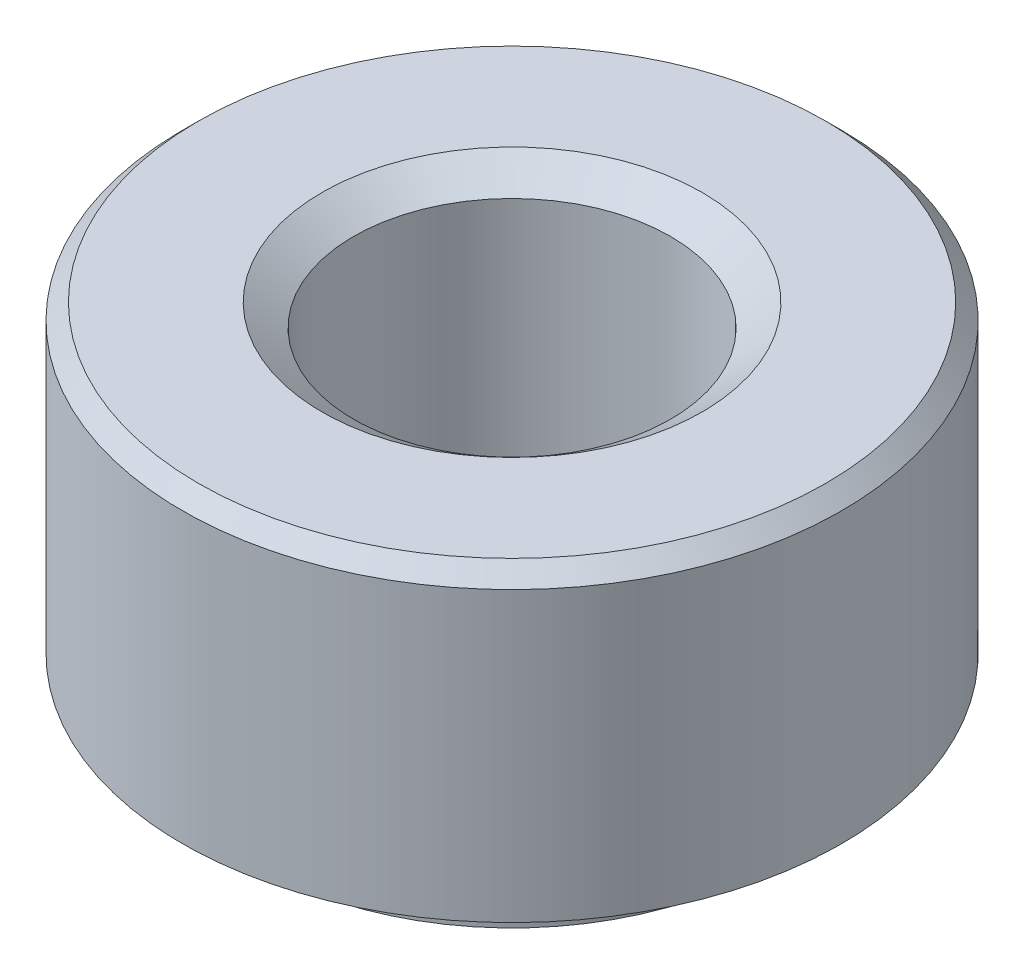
ISO-10303-21;
HEADER;
FILE_DESCRIPTION(('STEP AP214'),'2;1');
FILE_NAME('part.step','',(''),(''),'','','');
FILE_SCHEMA(('AUTOMOTIVE_DESIGN { 1 0 10303 214 1 1 1 1 }'));
ENDSEC;
DATA;
#1=APPLICATION_CONTEXT('core data for automotive mechanical design processes');
#2=APPLICATION_PROTOCOL_DEFINITION('international standard','automotive_design',2000,#1);
#3=PRODUCT_CONTEXT('',#1,'mechanical');
#4=PRODUCT('Part','Part','',(#3));
#5=PRODUCT_RELATED_PRODUCT_CATEGORY('part','',(#4));
#6=PRODUCT_DEFINITION_FORMATION('','',#4);
#7=PRODUCT_DEFINITION_CONTEXT('part definition',#1,'design');
#8=PRODUCT_DEFINITION('design','',#6,#7);
#9=PRODUCT_DEFINITION_SHAPE('','',#8);
#10=(LENGTH_UNIT() NAMED_UNIT(*) SI_UNIT(.MILLI.,.METRE.));
#11=(NAMED_UNIT(*) PLANE_ANGLE_UNIT() SI_UNIT($,.RADIAN.));
#12=(NAMED_UNIT(*) SI_UNIT($,.STERADIAN.) SOLID_ANGLE_UNIT());
#13=UNCERTAINTY_MEASURE_WITH_UNIT(LENGTH_MEASURE(1.E-05),#10,'distance_accuracy_value','');
#14=(GEOMETRIC_REPRESENTATION_CONTEXT(3) GLOBAL_UNCERTAINTY_ASSIGNED_CONTEXT((#13)) GLOBAL_UNIT_ASSIGNED_CONTEXT((#10,
#11,#12)) REPRESENTATION_CONTEXT('',''));
#15=CARTESIAN_POINT('',(0.,0.,0.));
#16=DIRECTION('',(0.,0.,1.));
#17=DIRECTION('',(1.,0.,0.));
#18=AXIS2_PLACEMENT_3D('',#15,#16,#17);
#19=CARTESIAN_POINT('',(0.,0.,0.));
#20=DIRECTION('',(0.,-1.,0.));
#21=DIRECTION('',(0.,0.,-1.));
#22=AXIS2_PLACEMENT_3D('',#19,#20,#21);
#23=CYLINDRICAL_SURFACE('',#22,7.29615);
#24=DIRECTION('',(0.,-1.,0.));
#25=VECTOR('',#24,1.);
#26=CARTESIAN_POINT('',(-7.29500746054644,-0.29464,0.129116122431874));
#27=LINE('',#26,#25);
#28=CARTESIAN_POINT('',(-7.29500746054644,0.,0.129116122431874));
#29=VERTEX_POINT('',#28);
#30=CARTESIAN_POINT('',(-7.29500746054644,-0.58928,0.129116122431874));
#31=VERTEX_POINT('',#30);
#32=EDGE_CURVE('E11',#29,#31,#27,.T.);
#33=ORIENTED_EDGE('',*,*,#32,.F.);
#34=CARTESIAN_POINT('',(0.,0.,0.));
#35=DIRECTION('',(0.,-1.,0.));
#36=DIRECTION('',(0.,0.,-1.));
#37=AXIS2_PLACEMENT_3D('',#34,#35,#36);
#38=CIRCLE('',#37,7.29615);
#39=CARTESIAN_POINT('',(-7.29500746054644,0.,-0.12911612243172));
#40=VERTEX_POINT('',#39);
#41=EDGE_CURVE('E535',#29,#40,#38,.T.);
#42=ORIENTED_EDGE('',*,*,#41,.T.);
#43=DIRECTION('',(0.,-1.,0.));
#44=VECTOR('',#43,1.);
#45=CARTESIAN_POINT('',(-7.29500746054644,-0.29464,-0.12911612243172));
#46=LINE('',#45,#44);
#47=CARTESIAN_POINT('',(-7.29500746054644,-0.58928,-0.12911612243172));
#48=VERTEX_POINT('',#47);
#49=EDGE_CURVE('E480',#48,#40,#46,.F.);
#50=ORIENTED_EDGE('',*,*,#49,.F.);
#51=CARTESIAN_POINT('',(0.,-0.58928,0.));
#52=DIRECTION('',(0.,-1.,0.));
#53=DIRECTION('',(0.,0.,-1.));
#54=AXIS2_PLACEMENT_3D('',#51,#52,#53);
#55=CIRCLE('',#54,7.29615);
#56=EDGE_CURVE('E830',#31,#48,#55,.T.);
#57=ORIENTED_EDGE('',*,*,#56,.F.);
#58=EDGE_LOOP('',(#33,#42,#50,#57));
#59=FACE_BOUND('',#58,.T.);
#60=ADVANCED_FACE('F33',(#59),#23,.T.);
#61=DIRECTION('',(0.,-1.,0.));
#62=VECTOR('',#61,1.);
#63=CARTESIAN_POINT('',(-6.25310372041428,-0.29464,3.75932157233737));
#64=LINE('',#63,#62);
#65=CARTESIAN_POINT('',(-6.25310372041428,0.,3.75932157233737));
#66=VERTEX_POINT('',#65);
#67=CARTESIAN_POINT('',(-6.25310372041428,-0.58928,3.75932157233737));
#68=VERTEX_POINT('',#67);
#69=EDGE_CURVE('E518',#66,#68,#64,.T.);
#70=ORIENTED_EDGE('',*,*,#69,.F.);
#71=CARTESIAN_POINT('',(-6.38221984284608,0.,3.53568588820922));
#72=VERTEX_POINT('',#71);
#73=EDGE_CURVE('E534',#66,#72,#38,.T.);
#74=ORIENTED_EDGE('',*,*,#73,.T.);
#75=DIRECTION('',(0.,-1.,0.));
#76=VECTOR('',#75,1.);
#77=CARTESIAN_POINT('',(-6.38221984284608,-0.29464,3.53568588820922));
#78=LINE('',#77,#76);
#79=CARTESIAN_POINT('',(-6.38221984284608,-0.58928,3.53568588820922));
#80=VERTEX_POINT('',#79);
#81=EDGE_CURVE('E510',#80,#72,#78,.F.);
#82=ORIENTED_EDGE('',*,*,#81,.F.);
#83=EDGE_CURVE('E827',#68,#80,#55,.T.);
#84=ORIENTED_EDGE('',*,*,#83,.F.);
#85=EDGE_LOOP('',(#70,#74,#82,#84));
#86=FACE_BOUND('',#85,.T.);
#87=ADVANCED_FACE('F752',(#86),#23,.T.);
#88=DIRECTION('',(0.,-1.,0.));
#89=VECTOR('',#88,1.);
#90=CARTESIAN_POINT('',(-7.07985382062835,-0.29464,1.7633702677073));
#91=LINE('',#90,#89);
#92=CARTESIAN_POINT('',(-7.07985382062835,-0.58928,1.7633702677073));
#93=VERTEX_POINT('',#92);
#94=CARTESIAN_POINT('',(-7.07985382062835,0.,1.7633702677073));
#95=VERTEX_POINT('',#94);
#96=EDGE_CURVE('E41',#93,#95,#91,.F.);
#97=ORIENTED_EDGE('',*,*,#96,.F.);
#98=CARTESIAN_POINT('',(-7.01301839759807,-0.58928,2.01280346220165));
#99=VERTEX_POINT('',#98);
#100=EDGE_CURVE('E828',#99,#93,#55,.T.);
#101=ORIENTED_EDGE('',*,*,#100,.F.);
#102=DIRECTION('',(0.,-1.,0.));
#103=VECTOR('',#102,1.);
#104=CARTESIAN_POINT('',(-7.01301839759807,-0.29464,2.01280346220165));
#105=LINE('',#104,#103);
#106=CARTESIAN_POINT('',(-7.01301839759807,0.,2.01280346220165));
#107=VERTEX_POINT('',#106);
#108=EDGE_CURVE('E513',#107,#99,#105,.T.);
#109=ORIENTED_EDGE('',*,*,#108,.F.);
#110=EDGE_CURVE('E532',#107,#95,#38,.T.);
#111=ORIENTED_EDGE('',*,*,#110,.T.);
#112=EDGE_LOOP('',(#97,#101,#109,#111));
#113=FACE_BOUND('',#112,.T.);
#114=ADVANCED_FACE('F533',(#113),#23,.T.);
#115=DIRECTION('',(0.,-1.,0.));
#116=VECTOR('',#115,1.);
#117=CARTESIAN_POINT('',(-1.76337026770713,-0.29464,7.0798538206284));
#118=LINE('',#117,#116);
#119=CARTESIAN_POINT('',(-1.76337026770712,0.,7.0798538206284));
#120=VERTEX_POINT('',#119);
#121=CARTESIAN_POINT('',(-1.76337026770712,-0.58928,7.0798538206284));
#122=VERTEX_POINT('',#121);
#123=EDGE_CURVE('E508',#120,#122,#118,.T.);
#124=ORIENTED_EDGE('',*,*,#123,.F.);
#125=CARTESIAN_POINT('',(-2.01280346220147,0.,7.01301839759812));
#126=VERTEX_POINT('',#125);
#127=EDGE_CURVE('E628',#120,#126,#38,.T.);
#128=ORIENTED_EDGE('',*,*,#127,.T.);
#129=DIRECTION('',(0.,-1.,0.));
#130=VECTOR('',#129,1.);
#131=CARTESIAN_POINT('',(-2.01280346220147,-0.29464,7.01301839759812));
#132=LINE('',#131,#130);
#133=CARTESIAN_POINT('',(-2.01280346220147,-0.58928,7.01301839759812));
#134=VERTEX_POINT('',#133);
#135=EDGE_CURVE('E500',#134,#126,#132,.F.);
#136=ORIENTED_EDGE('',*,*,#135,.F.);
#137=EDGE_CURVE('E376',#122,#134,#55,.T.);
#138=ORIENTED_EDGE('',*,*,#137,.F.);
#139=EDGE_LOOP('',(#124,#128,#136,#138));
#140=FACE_BOUND('',#139,.T.);
#141=ADVANCED_FACE('F823',(#140),#23,.T.);
#142=DIRECTION('',(0.,-1.,0.));
#143=VECTOR('',#142,1.);
#144=CARTESIAN_POINT('',(-3.53568588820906,-0.29464,6.38221984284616));
#145=LINE('',#144,#143);
#146=CARTESIAN_POINT('',(-3.53568588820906,0.,6.38221984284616));
#147=VERTEX_POINT('',#146);
#148=CARTESIAN_POINT('',(-3.53568588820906,-0.58928,6.38221984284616));
#149=VERTEX_POINT('',#148);
#150=EDGE_CURVE('E503',#147,#149,#145,.T.);
#151=ORIENTED_EDGE('',*,*,#150,.F.);
#152=CARTESIAN_POINT('',(-3.75932157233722,0.,6.25310372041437));
#153=VERTEX_POINT('',#152);
#154=EDGE_CURVE('E635',#147,#153,#38,.T.);
#155=ORIENTED_EDGE('',*,*,#154,.T.);
#156=DIRECTION('',(0.,-1.,0.));
#157=VECTOR('',#156,1.);
#158=CARTESIAN_POINT('',(-3.75932157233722,-0.29464,6.25310372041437));
#159=LINE('',#158,#157);
#160=CARTESIAN_POINT('',(-3.75932157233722,-0.58928,6.25310372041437));
#161=VERTEX_POINT('',#160);
#162=EDGE_CURVE('E495',#161,#153,#159,.F.);
#163=ORIENTED_EDGE('',*,*,#162,.F.);
#164=EDGE_CURVE('E824',#149,#161,#55,.T.);
#165=ORIENTED_EDGE('',*,*,#164,.F.);
#166=EDGE_LOOP('',(#151,#155,#163,#165));
#167=FACE_BOUND('',#166,.T.);
#168=ADVANCED_FACE('F1000',(#167),#23,.T.);
#169=DIRECTION('',(0.,-1.,0.));
#170=VECTOR('',#169,1.);
#171=CARTESIAN_POINT('',(-5.24964812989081,-0.29464,5.06705035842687));
#172=LINE('',#171,#170);
#173=CARTESIAN_POINT('',(-5.24964812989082,-0.58928,5.06705035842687));
#174=VERTEX_POINT('',#173);
#175=CARTESIAN_POINT('',(-5.24964812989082,0.,5.06705035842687));
#176=VERTEX_POINT('',#175);
#177=EDGE_CURVE('E515',#174,#176,#172,.F.);
#178=ORIENTED_EDGE('',*,*,#177,.F.);
#179=CARTESIAN_POINT('',(-5.06705035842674,-0.58928,5.24964812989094));
#180=VERTEX_POINT('',#179);
#181=EDGE_CURVE('E825',#180,#174,#55,.T.);
#182=ORIENTED_EDGE('',*,*,#181,.F.);
#183=DIRECTION('',(0.,-1.,0.));
#184=VECTOR('',#183,1.);
#185=CARTESIAN_POINT('',(-5.06705035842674,-0.29464,5.24964812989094));
#186=LINE('',#185,#184);
#187=CARTESIAN_POINT('',(-5.06705035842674,0.,5.24964812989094));
#188=VERTEX_POINT('',#187);
#189=EDGE_CURVE('E498',#188,#180,#186,.T.);
#190=ORIENTED_EDGE('',*,*,#189,.F.);
#191=EDGE_CURVE('E537',#188,#176,#38,.T.);
#192=ORIENTED_EDGE('',*,*,#191,.T.);
#193=EDGE_LOOP('',(#178,#182,#190,#192));
#194=FACE_BOUND('',#193,.T.);
#195=ADVANCED_FACE('F650',(#194),#23,.T.);
#196=DIRECTION('',(0.,-1.,0.));
#197=VECTOR('',#196,1.);
#198=CARTESIAN_POINT('',(-3.75932157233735,-0.29464,-6.25310372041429));
#199=LINE('',#198,#197);
#200=CARTESIAN_POINT('',(-3.75932157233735,0.,-6.25310372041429));
#201=VERTEX_POINT('',#200);
#202=CARTESIAN_POINT('',(-3.75932157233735,-0.58928,-6.25310372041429));
#203=VERTEX_POINT('',#202);
#204=EDGE_CURVE('E493',#201,#203,#199,.T.);
#205=ORIENTED_EDGE('',*,*,#204,.F.);
#206=CARTESIAN_POINT('',(-3.53568588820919,0.,-6.38221984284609));
#207=VERTEX_POINT('',#206);
#208=EDGE_CURVE('E556',#201,#207,#38,.T.);
#209=ORIENTED_EDGE('',*,*,#208,.T.);
#210=DIRECTION('',(0.,-1.,0.));
#211=VECTOR('',#210,1.);
#212=CARTESIAN_POINT('',(-3.53568588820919,-0.29464,-6.38221984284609));
#213=LINE('',#212,#211);
#214=CARTESIAN_POINT('',(-3.53568588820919,-0.58928,-6.38221984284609));
#215=VERTEX_POINT('',#214);
#216=EDGE_CURVE('E485',#215,#207,#213,.F.);
#217=ORIENTED_EDGE('',*,*,#216,.F.);
#218=EDGE_CURVE('E843',#203,#215,#55,.T.);
#219=ORIENTED_EDGE('',*,*,#218,.F.);
#220=EDGE_LOOP('',(#205,#209,#217,#219));
#221=FACE_BOUND('',#220,.T.);
#222=ADVANCED_FACE('F1015',(#221),#23,.T.);
#223=DIRECTION('',(0.,-1.,0.));
#224=VECTOR('',#223,1.);
#225=CARTESIAN_POINT('',(-2.01280346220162,-0.29464,-7.01301839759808));
#226=LINE('',#225,#224);
#227=CARTESIAN_POINT('',(-2.01280346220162,0.,-7.01301839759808));
#228=VERTEX_POINT('',#227);
#229=CARTESIAN_POINT('',(-2.01280346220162,-0.58928,-7.01301839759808));
#230=VERTEX_POINT('',#229);
#231=EDGE_CURVE('E488',#228,#230,#226,.T.);
#232=ORIENTED_EDGE('',*,*,#231,.F.);
#233=CARTESIAN_POINT('',(-1.76337026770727,0.,-7.07985382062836));
#234=VERTEX_POINT('',#233);
#235=EDGE_CURVE('E562',#228,#234,#38,.T.);
#236=ORIENTED_EDGE('',*,*,#235,.T.);
#237=DIRECTION('',(0.,-1.,0.));
#238=VECTOR('',#237,1.);
#239=CARTESIAN_POINT('',(-1.76337026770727,-0.29464,-7.07985382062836));
#240=LINE('',#239,#238);
#241=CARTESIAN_POINT('',(-1.76337026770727,-0.58928,-7.07985382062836));
#242=VERTEX_POINT('',#241);
#243=EDGE_CURVE('E440',#242,#234,#240,.F.);
#244=ORIENTED_EDGE('',*,*,#243,.F.);
#245=EDGE_CURVE('E847',#230,#242,#55,.T.);
#246=ORIENTED_EDGE('',*,*,#245,.F.);
#247=EDGE_LOOP('',(#232,#236,#244,#246));
#248=FACE_BOUND('',#247,.T.);
#249=ADVANCED_FACE('F1023',(#248),#23,.T.);
#250=DIRECTION('',(0.,-1.,0.));
#251=VECTOR('',#250,1.);
#252=CARTESIAN_POINT('',(-7.07985382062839,-0.29464,-1.76337026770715));
#253=LINE('',#252,#251);
#254=CARTESIAN_POINT('',(-7.07985382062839,0.,-1.76337026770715));
#255=VERTEX_POINT('',#254);
#256=CARTESIAN_POINT('',(-7.07985382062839,-0.58928,-1.76337026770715));
#257=VERTEX_POINT('',#256);
#258=EDGE_CURVE('E483',#255,#257,#253,.T.);
#259=ORIENTED_EDGE('',*,*,#258,.F.);
#260=CARTESIAN_POINT('',(-7.01301839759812,0.,-2.0128034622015));
#261=VERTEX_POINT('',#260);
#262=EDGE_CURVE('E539',#255,#261,#38,.T.);
#263=ORIENTED_EDGE('',*,*,#262,.T.);
#264=DIRECTION('',(0.,-1.,0.));
#265=VECTOR('',#264,1.);
#266=CARTESIAN_POINT('',(-7.01301839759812,-0.29464,-2.0128034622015));
#267=LINE('',#266,#265);
#268=CARTESIAN_POINT('',(-7.01301839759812,-0.58928,-2.0128034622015));
#269=VERTEX_POINT('',#268);
#270=EDGE_CURVE('E475',#269,#261,#267,.F.);
#271=ORIENTED_EDGE('',*,*,#270,.F.);
#272=EDGE_CURVE('E832',#257,#269,#55,.T.);
#273=ORIENTED_EDGE('',*,*,#272,.F.);
#274=EDGE_LOOP('',(#259,#263,#271,#273));
#275=FACE_BOUND('',#274,.T.);
#276=ADVANCED_FACE('F1031',(#275),#23,.T.);
#277=DIRECTION('',(0.,-1.,0.));
#278=VECTOR('',#277,1.);
#279=CARTESIAN_POINT('',(-6.38221984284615,-0.29464,-3.53568588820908));
#280=LINE('',#279,#278);
#281=CARTESIAN_POINT('',(-6.38221984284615,0.,-3.53568588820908));
#282=VERTEX_POINT('',#281);
#283=CARTESIAN_POINT('',(-6.38221984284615,-0.58928,-3.53568588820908));
#284=VERTEX_POINT('',#283);
#285=EDGE_CURVE('E478',#282,#284,#280,.T.);
#286=ORIENTED_EDGE('',*,*,#285,.F.);
#287=CARTESIAN_POINT('',(-6.25310372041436,0.,-3.75932157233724));
#288=VERTEX_POINT('',#287);
#289=EDGE_CURVE('E544',#282,#288,#38,.T.);
#290=ORIENTED_EDGE('',*,*,#289,.T.);
#291=DIRECTION('',(0.,-1.,0.));
#292=VECTOR('',#291,1.);
#293=CARTESIAN_POINT('',(-6.25310372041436,-0.29464,-3.75932157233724));
#294=LINE('',#293,#292);
#295=CARTESIAN_POINT('',(-6.25310372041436,-0.58928,-3.75932157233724));
#296=VERTEX_POINT('',#295);
#297=EDGE_CURVE('E470',#296,#288,#294,.F.);
#298=ORIENTED_EDGE('',*,*,#297,.F.);
#299=EDGE_CURVE('E835',#284,#296,#55,.T.);
#300=ORIENTED_EDGE('',*,*,#299,.F.);
#301=EDGE_LOOP('',(#286,#290,#298,#300));
#302=FACE_BOUND('',#301,.T.);
#303=ADVANCED_FACE('F1039',(#302),#23,.T.);
#304=DIRECTION('',(0.,-1.,0.));
#305=VECTOR('',#304,1.);
#306=CARTESIAN_POINT('',(-5.06705035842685,-0.29464,-5.24964812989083));
#307=LINE('',#306,#305);
#308=CARTESIAN_POINT('',(-5.06705035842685,-0.58928,-5.24964812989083));
#309=VERTEX_POINT('',#308);
#310=CARTESIAN_POINT('',(-5.06705035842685,0.,-5.24964812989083));
#311=VERTEX_POINT('',#310);
#312=EDGE_CURVE('E490',#309,#311,#307,.F.);
#313=ORIENTED_EDGE('',*,*,#312,.F.);
#314=CARTESIAN_POINT('',(-5.24964812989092,-0.58928,-5.06705035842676));
#315=VERTEX_POINT('',#314);
#316=EDGE_CURVE('E839',#315,#309,#55,.T.);
#317=ORIENTED_EDGE('',*,*,#316,.F.);
#318=DIRECTION('',(0.,-1.,0.));
#319=VECTOR('',#318,1.);
#320=CARTESIAN_POINT('',(-5.24964812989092,-0.29464,-5.06705035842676));
#321=LINE('',#320,#319);
#322=CARTESIAN_POINT('',(-5.24964812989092,0.,-5.06705035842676));
#323=VERTEX_POINT('',#322);
#324=EDGE_CURVE('E473',#323,#315,#321,.T.);
#325=ORIENTED_EDGE('',*,*,#324,.F.);
#326=EDGE_CURVE('E550',#323,#311,#38,.T.);
#327=ORIENTED_EDGE('',*,*,#326,.T.);
#328=EDGE_LOOP('',(#313,#317,#325,#327));
#329=FACE_BOUND('',#328,.T.);
#330=ADVANCED_FACE('F1047',(#329),#23,.T.);
#331=DIRECTION('',(0.,-1.,0.));
#332=VECTOR('',#331,1.);
#333=CARTESIAN_POINT('',(6.2531037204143,-0.29464,-3.75932157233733));
#334=LINE('',#333,#332);
#335=CARTESIAN_POINT('',(6.2531037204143,0.,-3.75932157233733));
#336=VERTEX_POINT('',#335);
#337=CARTESIAN_POINT('',(6.2531037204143,-0.58928,-3.75932157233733));
#338=VERTEX_POINT('',#337);
#339=EDGE_CURVE('E468',#336,#338,#334,.T.);
#340=ORIENTED_EDGE('',*,*,#339,.F.);
#341=CARTESIAN_POINT('',(6.3822198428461,0.,-3.53568588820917));
#342=VERTEX_POINT('',#341);
#343=EDGE_CURVE('E592',#336,#342,#38,.T.);
#344=ORIENTED_EDGE('',*,*,#343,.T.);
#345=DIRECTION('',(0.,-1.,0.));
#346=VECTOR('',#345,1.);
#347=CARTESIAN_POINT('',(6.3822198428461,-0.29464,-3.53568588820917));
#348=LINE('',#347,#346);
#349=CARTESIAN_POINT('',(6.3822198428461,-0.58928,-3.53568588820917));
#350=VERTEX_POINT('',#349);
#351=EDGE_CURVE('E455',#350,#342,#348,.F.);
#352=ORIENTED_EDGE('',*,*,#351,.F.);
#353=EDGE_CURVE('E366',#338,#350,#55,.T.);
#354=ORIENTED_EDGE('',*,*,#353,.F.);
#355=EDGE_LOOP('',(#340,#344,#352,#354));
#356=FACE_BOUND('',#355,.T.);
#357=ADVANCED_FACE('F872',(#356),#23,.T.);
#358=DIRECTION('',(0.,-1.,0.));
#359=VECTOR('',#358,1.);
#360=CARTESIAN_POINT('',(5.24964812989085,-0.29464,-5.06705035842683));
#361=LINE('',#360,#359);
#362=CARTESIAN_POINT('',(5.24964812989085,-0.58928,-5.06705035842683));
#363=VERTEX_POINT('',#362);
#364=CARTESIAN_POINT('',(5.24964812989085,0.,-5.06705035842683));
#365=VERTEX_POINT('',#364);
#366=EDGE_CURVE('E465',#363,#365,#361,.F.);
#367=ORIENTED_EDGE('',*,*,#366,.F.);
#368=CARTESIAN_POINT('',(5.06705035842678,-0.58928,-5.2496481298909));
#369=VERTEX_POINT('',#368);
#370=EDGE_CURVE('E369',#369,#363,#55,.T.);
#371=ORIENTED_EDGE('',*,*,#370,.F.);
#372=DIRECTION('',(0.,-1.,0.));
#373=VECTOR('',#372,1.);
#374=CARTESIAN_POINT('',(5.06705035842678,-0.29464,-5.2496481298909));
#375=LINE('',#374,#373);
#376=CARTESIAN_POINT('',(5.06705035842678,0.,-5.2496481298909));
#377=VERTEX_POINT('',#376);
#378=EDGE_CURVE('E463',#377,#369,#375,.T.);
#379=ORIENTED_EDGE('',*,*,#378,.F.);
#380=EDGE_CURVE('E586',#377,#365,#38,.T.);
#381=ORIENTED_EDGE('',*,*,#380,.T.);
#382=EDGE_LOOP('',(#367,#371,#379,#381));
#383=FACE_BOUND('',#382,.T.);
#384=ADVANCED_FACE('F869',(#383),#23,.T.);
#385=DIRECTION('',(0.,-1.,0.));
#386=VECTOR('',#385,1.);
#387=CARTESIAN_POINT('',(7.01301839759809,-0.29464,-2.0128034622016));
#388=LINE('',#387,#386);
#389=CARTESIAN_POINT('',(7.01301839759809,0.,-2.0128034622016));
#390=VERTEX_POINT('',#389);
#391=CARTESIAN_POINT('',(7.01301839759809,-0.58928,-2.0128034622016));
#392=VERTEX_POINT('',#391);
#393=EDGE_CURVE('E458',#390,#392,#388,.T.);
#394=ORIENTED_EDGE('',*,*,#393,.F.);
#395=CARTESIAN_POINT('',(7.07985382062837,0.,-1.76337026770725));
#396=VERTEX_POINT('',#395);
#397=EDGE_CURVE('E357',#390,#396,#38,.T.);
#398=ORIENTED_EDGE('',*,*,#397,.T.);
#399=DIRECTION('',(0.,-1.,0.));
#400=VECTOR('',#399,1.);
#401=CARTESIAN_POINT('',(7.07985382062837,-0.29464,-1.76337026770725));
#402=LINE('',#401,#400);
#403=CARTESIAN_POINT('',(7.07985382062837,-0.58928,-1.76337026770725));
#404=VERTEX_POINT('',#403);
#405=EDGE_CURVE('E340',#404,#396,#402,.F.);
#406=ORIENTED_EDGE('',*,*,#405,.F.);
#407=EDGE_CURVE('E355',#392,#404,#55,.T.);
#408=ORIENTED_EDGE('',*,*,#407,.F.);
#409=EDGE_LOOP('',(#394,#398,#406,#408));
#410=FACE_BOUND('',#409,.T.);
#411=ADVANCED_FACE('F354',(#410),#23,.T.);
#412=DIRECTION('',(0.,-1.,0.));
#413=VECTOR('',#412,1.);
#414=CARTESIAN_POINT('',(3.75932157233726,-0.29464,-6.25310372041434));
#415=LINE('',#414,#413);
#416=CARTESIAN_POINT('',(3.75932157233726,-0.58928,-6.25310372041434));
#417=VERTEX_POINT('',#416);
#418=CARTESIAN_POINT('',(3.75932157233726,0.,-6.25310372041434));
#419=VERTEX_POINT('',#418);
#420=EDGE_CURVE('E460',#417,#419,#415,.F.);
#421=ORIENTED_EDGE('',*,*,#420,.F.);
#422=CARTESIAN_POINT('',(3.5356858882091,-0.58928,-6.38221984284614));
#423=VERTEX_POINT('',#422);
#424=EDGE_CURVE('E859',#423,#417,#55,.T.);
#425=ORIENTED_EDGE('',*,*,#424,.F.);
#426=DIRECTION('',(0.,-1.,0.));
#427=VECTOR('',#426,1.);
#428=CARTESIAN_POINT('',(3.5356858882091,-0.29464,-6.38221984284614));
#429=LINE('',#428,#427);
#430=CARTESIAN_POINT('',(3.5356858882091,0.,-6.38221984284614));
#431=VERTEX_POINT('',#430);
#432=EDGE_CURVE('E453',#431,#423,#429,.T.);
#433=ORIENTED_EDGE('',*,*,#432,.F.);
#434=EDGE_CURVE('E580',#431,#419,#38,.T.);
#435=ORIENTED_EDGE('',*,*,#434,.T.);
#436=EDGE_LOOP('',(#421,#425,#433,#435));
#437=FACE_BOUND('',#436,.T.);
#438=ADVANCED_FACE('F1076',(#437),#23,.T.);
#439=DIRECTION('',(0.,-1.,0.));
#440=VECTOR('',#439,1.);
#441=CARTESIAN_POINT('',(2.01280346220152,-0.29464,-7.01301839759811));
#442=LINE('',#441,#440);
#443=CARTESIAN_POINT('',(2.01280346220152,-0.58928,-7.01301839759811));
#444=VERTEX_POINT('',#443);
#445=CARTESIAN_POINT('',(2.01280346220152,0.,-7.01301839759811));
#446=VERTEX_POINT('',#445);
#447=EDGE_CURVE('E450',#444,#446,#442,.F.);
#448=ORIENTED_EDGE('',*,*,#447,.F.);
#449=CARTESIAN_POINT('',(1.76337026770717,-0.58928,-7.07985382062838));
#450=VERTEX_POINT('',#449);
#451=EDGE_CURVE('E855',#450,#444,#55,.T.);
#452=ORIENTED_EDGE('',*,*,#451,.F.);
#453=DIRECTION('',(0.,-1.,0.));
#454=VECTOR('',#453,1.);
#455=CARTESIAN_POINT('',(1.76337026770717,-0.29464,-7.07985382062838));
#456=LINE('',#455,#454);
#457=CARTESIAN_POINT('',(1.76337026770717,0.,-7.07985382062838));
#458=VERTEX_POINT('',#457);
#459=EDGE_CURVE('E448',#458,#450,#456,.T.);
#460=ORIENTED_EDGE('',*,*,#459,.F.);
#461=EDGE_CURVE('E574',#458,#446,#38,.T.);
#462=ORIENTED_EDGE('',*,*,#461,.T.);
#463=EDGE_LOOP('',(#448,#452,#460,#462));
#464=FACE_BOUND('',#463,.T.);
#465=ADVANCED_FACE('F1084',(#464),#23,.T.);
#466=DIRECTION('',(0.,-1.,0.));
#467=VECTOR('',#466,1.);
#468=CARTESIAN_POINT('',(0.129116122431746,-0.29464,-7.29500746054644));
#469=LINE('',#468,#467);
#470=CARTESIAN_POINT('',(0.129116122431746,-0.58928,-7.29500746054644));
#471=VERTEX_POINT('',#470);
#472=CARTESIAN_POINT('',(0.129116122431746,0.,-7.29500746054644));
#473=VERTEX_POINT('',#472);
#474=EDGE_CURVE('E445',#471,#473,#469,.F.);
#475=ORIENTED_EDGE('',*,*,#474,.F.);
#476=CARTESIAN_POINT('',(-0.129116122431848,-0.58928,-7.29500746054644));
#477=VERTEX_POINT('',#476);
#478=EDGE_CURVE('E851',#477,#471,#55,.T.);
#479=ORIENTED_EDGE('',*,*,#478,.F.);
#480=DIRECTION('',(0.,-1.,0.));
#481=VECTOR('',#480,1.);
#482=CARTESIAN_POINT('',(-0.129116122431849,-0.29464,-7.29500746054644));
#483=LINE('',#482,#481);
#484=CARTESIAN_POINT('',(-0.129116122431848,0.,-7.29500746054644));
#485=VERTEX_POINT('',#484);
#486=EDGE_CURVE('E443',#485,#477,#483,.T.);
#487=ORIENTED_EDGE('',*,*,#486,.F.);
#488=EDGE_CURVE('E568',#485,#473,#38,.T.);
#489=ORIENTED_EDGE('',*,*,#488,.T.);
#490=EDGE_LOOP('',(#475,#479,#487,#489));
#491=FACE_BOUND('',#490,.T.);
#492=ADVANCED_FACE('F1092',(#491),#23,.T.);
#493=DIRECTION('',(0.,-1.,0.));
#494=VECTOR('',#493,1.);
#495=CARTESIAN_POINT('',(5.24964812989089,-0.29464,5.06705035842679));
#496=LINE('',#495,#494);
#497=CARTESIAN_POINT('',(5.24964812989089,0.,5.06705035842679));
#498=VERTEX_POINT('',#497);
#499=CARTESIAN_POINT('',(5.24964812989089,-0.58928,5.06705035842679));
#500=VERTEX_POINT('',#499);
#501=EDGE_CURVE('E438',#498,#500,#496,.T.);
#502=ORIENTED_EDGE('',*,*,#501,.F.);
#503=CARTESIAN_POINT('',(5.06705035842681,0.,5.24964812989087));
#504=VERTEX_POINT('',#503);
#505=EDGE_CURVE('E615',#498,#504,#38,.T.);
#506=ORIENTED_EDGE('',*,*,#505,.T.);
#507=DIRECTION('',(0.,-1.,0.));
#508=VECTOR('',#507,1.);
#509=CARTESIAN_POINT('',(5.06705035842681,-0.29464,5.24964812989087));
#510=LINE('',#509,#508);
#511=CARTESIAN_POINT('',(5.06705035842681,-0.58928,5.24964812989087));
#512=VERTEX_POINT('',#511);
#513=EDGE_CURVE('E432',#512,#504,#510,.F.);
#514=ORIENTED_EDGE('',*,*,#513,.F.);
#515=EDGE_CURVE('E1363',#500,#512,#55,.T.);
#516=ORIENTED_EDGE('',*,*,#515,.F.);
#517=EDGE_LOOP('',(#502,#506,#514,#516));
#518=FACE_BOUND('',#517,.T.);
#519=ADVANCED_FACE('F1100',(#518),#23,.T.);
#520=DIRECTION('',(0.,-1.,0.));
#521=VECTOR('',#520,1.);
#522=CARTESIAN_POINT('',(3.7593215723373,-0.29464,6.25310372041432));
#523=LINE('',#522,#521);
#524=CARTESIAN_POINT('',(3.7593215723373,0.,6.25310372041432));
#525=VERTEX_POINT('',#524);
#526=CARTESIAN_POINT('',(3.7593215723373,-0.58928,6.25310372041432));
#527=VERTEX_POINT('',#526);
#528=EDGE_CURVE('E434',#525,#527,#523,.T.);
#529=ORIENTED_EDGE('',*,*,#528,.F.);
#530=CARTESIAN_POINT('',(3.53568588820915,0.,6.38221984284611));
#531=VERTEX_POINT('',#530);
#532=EDGE_CURVE('E620',#525,#531,#38,.T.);
#533=ORIENTED_EDGE('',*,*,#532,.T.);
#534=DIRECTION('',(0.,-1.,0.));
#535=VECTOR('',#534,1.);
#536=CARTESIAN_POINT('',(3.53568588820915,-0.29464,6.38221984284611));
#537=LINE('',#536,#535);
#538=CARTESIAN_POINT('',(3.53568588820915,-0.58928,6.38221984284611));
#539=VERTEX_POINT('',#538);
#540=EDGE_CURVE('E417',#539,#531,#537,.F.);
#541=ORIENTED_EDGE('',*,*,#540,.F.);
#542=EDGE_CURVE('E377',#527,#539,#55,.T.);
#543=ORIENTED_EDGE('',*,*,#542,.F.);
#544=EDGE_LOOP('',(#529,#533,#541,#543));
#545=FACE_BOUND('',#544,.T.);
#546=ADVANCED_FACE('F1108',(#545),#23,.T.);
#547=DIRECTION('',(0.,-1.,0.));
#548=VECTOR('',#547,1.);
#549=CARTESIAN_POINT('',(6.25310372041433,-0.29464,3.75932157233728));
#550=LINE('',#549,#548);
#551=CARTESIAN_POINT('',(6.25310372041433,-0.58928,3.75932157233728));
#552=VERTEX_POINT('',#551);
#553=CARTESIAN_POINT('',(6.25310372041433,0.,3.75932157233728));
#554=VERTEX_POINT('',#553);
#555=EDGE_CURVE('E436',#552,#554,#550,.F.);
#556=ORIENTED_EDGE('',*,*,#555,.F.);
#557=CARTESIAN_POINT('',(6.38221984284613,-0.58928,3.53568588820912));
#558=VERTEX_POINT('',#557);
#559=EDGE_CURVE('E1366',#558,#552,#55,.T.);
#560=ORIENTED_EDGE('',*,*,#559,.F.);
#561=DIRECTION('',(0.,-1.,0.));
#562=VECTOR('',#561,1.);
#563=CARTESIAN_POINT('',(6.38221984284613,-0.29464,3.53568588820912));
#564=LINE('',#563,#562);
#565=CARTESIAN_POINT('',(6.38221984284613,0.,3.53568588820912));
#566=VERTEX_POINT('',#565);
#567=EDGE_CURVE('E430',#566,#558,#564,.T.);
#568=ORIENTED_EDGE('',*,*,#567,.F.);
#569=EDGE_CURVE('E609',#566,#554,#38,.T.);
#570=ORIENTED_EDGE('',*,*,#569,.T.);
#571=EDGE_LOOP('',(#556,#560,#568,#570));
#572=FACE_BOUND('',#571,.T.);
#573=ADVANCED_FACE('F1116',(#572),#23,.T.);
#574=DIRECTION('',(0.,-1.,0.));
#575=VECTOR('',#574,1.);
#576=CARTESIAN_POINT('',(7.0130183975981,-0.29464,2.01280346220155));
#577=LINE('',#576,#575);
#578=CARTESIAN_POINT('',(7.0130183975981,-0.58928,2.01280346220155));
#579=VERTEX_POINT('',#578);
#580=CARTESIAN_POINT('',(7.0130183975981,0.,2.01280346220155));
#581=VERTEX_POINT('',#580);
#582=EDGE_CURVE('E427',#579,#581,#577,.F.);
#583=ORIENTED_EDGE('',*,*,#582,.F.);
#584=CARTESIAN_POINT('',(7.07985382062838,-0.58928,1.7633702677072));
#585=VERTEX_POINT('',#584);
#586=EDGE_CURVE('E370',#585,#579,#55,.T.);
#587=ORIENTED_EDGE('',*,*,#586,.F.);
#588=DIRECTION('',(0.,-1.,0.));
#589=VECTOR('',#588,1.);
#590=CARTESIAN_POINT('',(7.07985382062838,-0.29464,1.7633702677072));
#591=LINE('',#590,#589);
#592=CARTESIAN_POINT('',(7.07985382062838,0.,1.7633702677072));
#593=VERTEX_POINT('',#592);
#594=EDGE_CURVE('E425',#593,#585,#591,.T.);
#595=ORIENTED_EDGE('',*,*,#594,.F.);
#596=EDGE_CURVE('E604',#593,#581,#38,.T.);
#597=ORIENTED_EDGE('',*,*,#596,.T.);
#598=EDGE_LOOP('',(#583,#587,#595,#597));
#599=FACE_BOUND('',#598,.T.);
#600=ADVANCED_FACE('F772',(#599),#23,.T.);
#601=DIRECTION('',(0.,-1.,0.));
#602=VECTOR('',#601,1.);
#603=CARTESIAN_POINT('',(7.29500746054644,-0.29464,0.129116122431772));
#604=LINE('',#603,#602);
#605=CARTESIAN_POINT('',(7.29500746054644,-0.58928,0.129116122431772));
#606=VERTEX_POINT('',#605);
#607=CARTESIAN_POINT('',(7.29500746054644,0.,0.129116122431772));
#608=VERTEX_POINT('',#607);
#609=EDGE_CURVE('E422',#606,#608,#604,.F.);
#610=ORIENTED_EDGE('',*,*,#609,.F.);
#611=CARTESIAN_POINT('',(7.29500746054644,-0.58928,-0.129116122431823));
#612=VERTEX_POINT('',#611);
#613=EDGE_CURVE('E367',#612,#606,#55,.T.);
#614=ORIENTED_EDGE('',*,*,#613,.F.);
#615=DIRECTION('',(0.,-1.,0.));
#616=VECTOR('',#615,1.);
#617=CARTESIAN_POINT('',(7.29500746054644,-0.29464,-0.129116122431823));
#618=LINE('',#617,#616);
#619=CARTESIAN_POINT('',(7.29500746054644,0.,-0.129116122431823));
#620=VERTEX_POINT('',#619);
#621=EDGE_CURVE('E343',#620,#612,#618,.T.);
#622=ORIENTED_EDGE('',*,*,#621,.F.);
#623=EDGE_CURVE('E602',#620,#608,#38,.T.);
#624=ORIENTED_EDGE('',*,*,#623,.T.);
#625=EDGE_LOOP('',(#610,#614,#622,#624));
#626=FACE_BOUND('',#625,.T.);
#627=ADVANCED_FACE('F765',(#626),#23,.T.);
#628=DIRECTION('',(0.,-1.,0.));
#629=VECTOR('',#628,1.);
#630=CARTESIAN_POINT('',(2.01280346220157,-0.29464,7.01301839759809));
#631=LINE('',#630,#629);
#632=CARTESIAN_POINT('',(2.01280346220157,0.,7.0130183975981));
#633=VERTEX_POINT('',#632);
#634=CARTESIAN_POINT('',(2.01280346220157,-0.58928,7.0130183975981));
#635=VERTEX_POINT('',#634);
#636=EDGE_CURVE('E358',#633,#635,#631,.T.);
#637=ORIENTED_EDGE('',*,*,#636,.F.);
#638=CARTESIAN_POINT('',(1.76337026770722,0.,7.07985382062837));
#639=VERTEX_POINT('',#638);
#640=EDGE_CURVE('E411',#633,#639,#38,.T.);
#641=ORIENTED_EDGE('',*,*,#640,.T.);
#642=DIRECTION('',(0.,-1.,0.));
#643=VECTOR('',#642,1.);
#644=CARTESIAN_POINT('',(1.76337026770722,-0.29464,7.07985382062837));
#645=LINE('',#644,#643);
#646=CARTESIAN_POINT('',(1.76337026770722,-0.58928,7.07985382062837));
#647=VERTEX_POINT('',#646);
#648=EDGE_CURVE('E407',#647,#639,#645,.F.);
#649=ORIENTED_EDGE('',*,*,#648,.F.);
#650=EDGE_CURVE('E378',#635,#647,#55,.T.);
#651=ORIENTED_EDGE('',*,*,#650,.F.);
#652=EDGE_LOOP('',(#637,#641,#649,#651));
#653=FACE_BOUND('',#652,.T.);
#654=ADVANCED_FACE('F759',(#653),#23,.T.);
#655=CARTESIAN_POINT('',(7.29615,0.,0.));
#656=DIRECTION('',(0.,-1.,0.));
#657=DIRECTION('',(0.,0.,-1.));
#658=AXIS2_PLACEMENT_3D('',#655,#656,#657);
#659=PLANE('',#658);
#660=ORIENTED_EDGE('',*,*,#41,.F.);
#661=CARTESIAN_POINT('',(-7.23373042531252,0.,0.952338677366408));
#662=DIRECTION('',(0.,-1.,0.));
#663=DIRECTION('',(1.,0.,0.));
#664=AXIS2_PLACEMENT_3D('',#661,#662,#663);
#665=CIRCLE('',#664,0.8255);
#666=EDGE_CURVE('E524',#29,#95,#665,.T.);
#667=ORIENTED_EDGE('',*,*,#666,.T.);
#668=ORIENTED_EDGE('',*,*,#110,.F.);
#669=CARTESIAN_POINT('',(-6.74076365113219,0.,2.79211572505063));
#670=DIRECTION('',(0.,-1.,0.));
#671=DIRECTION('',(0.965925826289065,0.,-0.258819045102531));
#672=AXIS2_PLACEMENT_3D('',#669,#670,#671);
#673=CIRCLE('',#672,0.8255);
#674=EDGE_CURVE('E672',#107,#72,#673,.T.);
#675=ORIENTED_EDGE('',*,*,#674,.T.);
#676=ORIENTED_EDGE('',*,*,#73,.F.);
#677=CARTESIAN_POINT('',(-5.78842497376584,0.,4.44161470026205));
#678=DIRECTION('',(0.,-1.,0.));
#679=DIRECTION('',(0.866025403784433,0.,-0.50000000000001));
#680=AXIS2_PLACEMENT_3D('',#677,#678,#679);
#681=CIRCLE('',#680,0.8255);
#682=EDGE_CURVE('E657',#66,#176,#681,.T.);
#683=ORIENTED_EDGE('',*,*,#682,.T.);
#684=ORIENTED_EDGE('',*,*,#191,.F.);
#685=CARTESIAN_POINT('',(-4.4416147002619,0.,5.78842497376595));
#686=DIRECTION('',(0.,-1.,0.));
#687=DIRECTION('',(0.707106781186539,0.,-0.707106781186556));
#688=AXIS2_PLACEMENT_3D('',#685,#686,#687);
#689=CIRCLE('',#688,0.8255);
#690=EDGE_CURVE('E655',#188,#153,#689,.T.);
#691=ORIENTED_EDGE('',*,*,#690,.T.);
#692=ORIENTED_EDGE('',*,*,#154,.F.);
#693=CARTESIAN_POINT('',(-2.79211572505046,0.,6.74076365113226));
#694=DIRECTION('',(0.,-1.,0.));
#695=DIRECTION('',(0.499999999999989,0.,-0.866025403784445));
#696=AXIS2_PLACEMENT_3D('',#693,#694,#695);
#697=CIRCLE('',#696,0.8255);
#698=EDGE_CURVE('E796',#147,#126,#697,.T.);
#699=ORIENTED_EDGE('',*,*,#698,.T.);
#700=ORIENTED_EDGE('',*,*,#127,.F.);
#701=CARTESIAN_POINT('',(-0.952338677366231,0.,7.23373042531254));
#702=DIRECTION('',(0.,-1.,0.));
#703=DIRECTION('',(0.258819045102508,0.,-0.965925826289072));
#704=AXIS2_PLACEMENT_3D('',#701,#702,#703);
#705=CIRCLE('',#704,0.8255);
#706=CARTESIAN_POINT('',(-0.129116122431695,0.,7.29500746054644));
#707=VERTEX_POINT('',#706);
#708=EDGE_CURVE('E786',#120,#707,#705,.T.);
#709=ORIENTED_EDGE('',*,*,#708,.T.);
#710=CARTESIAN_POINT('',(0.129116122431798,0.,7.29500746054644));
#711=VERTEX_POINT('',#710);
#712=EDGE_CURVE('E379',#711,#707,#38,.T.);
#713=ORIENTED_EDGE('',*,*,#712,.F.);
#714=CARTESIAN_POINT('',(0.952338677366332,0.,7.23373042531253));
#715=DIRECTION('',(0.,-1.,0.));
#716=DIRECTION('',(0.,0.,-1.));
#717=AXIS2_PLACEMENT_3D('',#714,#715,#716);
#718=CIRCLE('',#717,0.8255);
#719=EDGE_CURVE('E719',#711,#639,#718,.T.);
#720=ORIENTED_EDGE('',*,*,#719,.T.);
#721=ORIENTED_EDGE('',*,*,#640,.F.);
#722=CARTESIAN_POINT('',(2.79211572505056,0.,6.74076365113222));
#723=DIRECTION('',(0.,-1.,0.));
#724=DIRECTION('',(-0.258819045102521,0.,-0.965925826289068));
#725=AXIS2_PLACEMENT_3D('',#722,#723,#724);
#726=CIRCLE('',#725,0.8255);
#727=EDGE_CURVE('E714',#633,#531,#726,.T.);
#728=ORIENTED_EDGE('',*,*,#727,.T.);
#729=ORIENTED_EDGE('',*,*,#532,.F.);
#730=CARTESIAN_POINT('',(4.44161470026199,0.,5.78842497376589));
#731=DIRECTION('',(0.,-1.,0.));
#732=DIRECTION('',(-0.500000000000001,0.,-0.866025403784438));
#733=AXIS2_PLACEMENT_3D('',#730,#731,#732);
#734=CIRCLE('',#733,0.8255);
#735=EDGE_CURVE('E48',#525,#504,#734,.T.);
#736=ORIENTED_EDGE('',*,*,#735,.T.);
#737=ORIENTED_EDGE('',*,*,#505,.F.);
#738=CARTESIAN_POINT('',(5.78842497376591,0.,4.44161470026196));
#739=DIRECTION('',(0.,-1.,0.));
#740=DIRECTION('',(-0.707106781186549,0.,-0.707106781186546));
#741=AXIS2_PLACEMENT_3D('',#738,#739,#740);
#742=CIRCLE('',#741,0.8255);
#743=EDGE_CURVE('E54',#498,#554,#742,.T.);
#744=ORIENTED_EDGE('',*,*,#743,.T.);
#745=ORIENTED_EDGE('',*,*,#569,.F.);
#746=CARTESIAN_POINT('',(6.74076365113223,0.,2.79211572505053));
#747=DIRECTION('',(0.,-1.,0.));
#748=DIRECTION('',(-0.86602540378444,0.,-0.499999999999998));
#749=AXIS2_PLACEMENT_3D('',#746,#747,#748);
#750=CIRCLE('',#749,0.8255);
#751=EDGE_CURVE('E675',#566,#581,#750,.T.);
#752=ORIENTED_EDGE('',*,*,#751,.T.);
#753=ORIENTED_EDGE('',*,*,#596,.F.);
#754=CARTESIAN_POINT('',(7.23373042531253,0.,0.952338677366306));
#755=DIRECTION('',(0.,-1.,0.));
#756=DIRECTION('',(-0.965925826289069,0.,-0.258819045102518));
#757=AXIS2_PLACEMENT_3D('',#754,#755,#756);
#758=CIRCLE('',#757,0.8255);
#759=EDGE_CURVE('E680',#593,#608,#758,.T.);
#760=ORIENTED_EDGE('',*,*,#759,.T.);
#761=ORIENTED_EDGE('',*,*,#623,.F.);
#762=CARTESIAN_POINT('',(7.23373042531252,0.,-0.952338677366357));
#763=DIRECTION('',(0.,-1.,0.));
#764=DIRECTION('',(-1.,0.,0.));
#765=AXIS2_PLACEMENT_3D('',#762,#763,#764);
#766=CIRCLE('',#765,0.8255);
#767=EDGE_CURVE('E348',#620,#396,#766,.T.);
#768=ORIENTED_EDGE('',*,*,#767,.T.);
#769=ORIENTED_EDGE('',*,*,#397,.F.);
#770=CARTESIAN_POINT('',(6.74076365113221,0.,-2.79211572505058));
#771=DIRECTION('',(0.,-1.,0.));
#772=DIRECTION('',(-0.965925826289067,0.,0.258819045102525));
#773=AXIS2_PLACEMENT_3D('',#770,#771,#772);
#774=CIRCLE('',#773,0.8255);
#775=EDGE_CURVE('E349',#390,#342,#774,.T.);
#776=ORIENTED_EDGE('',*,*,#775,.T.);
#777=ORIENTED_EDGE('',*,*,#343,.F.);
#778=CARTESIAN_POINT('',(5.78842497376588,0.,-4.44161470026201));
#779=DIRECTION('',(0.,-1.,0.));
#780=DIRECTION('',(-0.866025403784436,0.,0.500000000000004));
#781=AXIS2_PLACEMENT_3D('',#778,#779,#780);
#782=CIRCLE('',#781,0.8255);
#783=EDGE_CURVE('E709',#336,#365,#782,.T.);
#784=ORIENTED_EDGE('',*,*,#783,.T.);
#785=ORIENTED_EDGE('',*,*,#380,.F.);
#786=CARTESIAN_POINT('',(4.44161470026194,0.,-5.78842497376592));
#787=DIRECTION('',(0.,-1.,0.));
#788=DIRECTION('',(-0.707106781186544,0.,0.707106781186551));
#789=AXIS2_PLACEMENT_3D('',#786,#787,#788);
#790=CIRCLE('',#789,0.8255);
#791=EDGE_CURVE('E705',#377,#419,#790,.T.);
#792=ORIENTED_EDGE('',*,*,#791,.T.);
#793=ORIENTED_EDGE('',*,*,#434,.F.);
#794=CARTESIAN_POINT('',(2.79211572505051,0.,-6.74076365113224));
#795=DIRECTION('',(0.,-1.,0.));
#796=DIRECTION('',(-0.499999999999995,0.,0.866025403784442));
#797=AXIS2_PLACEMENT_3D('',#794,#795,#796);
#798=CIRCLE('',#797,0.8255);
#799=EDGE_CURVE('E691',#431,#446,#798,.T.);
#800=ORIENTED_EDGE('',*,*,#799,.T.);
#801=ORIENTED_EDGE('',*,*,#461,.F.);
#802=CARTESIAN_POINT('',(0.952338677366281,0.,-7.23373042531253));
#803=DIRECTION('',(0.,-1.,0.));
#804=DIRECTION('',(-0.258819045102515,0.,0.96592582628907));
#805=AXIS2_PLACEMENT_3D('',#802,#803,#804);
#806=CIRCLE('',#805,0.8255);
#807=EDGE_CURVE('E696',#458,#473,#806,.T.);
#808=ORIENTED_EDGE('',*,*,#807,.T.);
#809=ORIENTED_EDGE('',*,*,#488,.F.);
#810=CARTESIAN_POINT('',(-0.952338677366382,0.,-7.23373042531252));
#811=DIRECTION('',(0.,-1.,0.));
#812=DIRECTION('',(0.,0.,1.));
#813=AXIS2_PLACEMENT_3D('',#810,#811,#812);
#814=CIRCLE('',#813,0.8255);
#815=EDGE_CURVE('E700',#485,#234,#814,.T.);
#816=ORIENTED_EDGE('',*,*,#815,.T.);
#817=ORIENTED_EDGE('',*,*,#235,.F.);
#818=CARTESIAN_POINT('',(-2.7921157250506,0.,-6.7407636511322));
#819=DIRECTION('',(0.,-1.,0.));
#820=DIRECTION('',(0.258819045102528,0.,0.965925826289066));
#821=AXIS2_PLACEMENT_3D('',#818,#819,#820);
#822=CIRCLE('',#821,0.8255);
#823=EDGE_CURVE('E704',#228,#207,#822,.T.);
#824=ORIENTED_EDGE('',*,*,#823,.T.);
#825=ORIENTED_EDGE('',*,*,#208,.F.);
#826=CARTESIAN_POINT('',(-4.44161470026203,0.,-5.78842497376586));
#827=DIRECTION('',(0.,-1.,0.));
#828=DIRECTION('',(0.500000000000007,0.,0.866025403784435));
#829=AXIS2_PLACEMENT_3D('',#826,#827,#828);
#830=CIRCLE('',#829,0.8255);
#831=EDGE_CURVE('E812',#201,#311,#830,.T.);
#832=ORIENTED_EDGE('',*,*,#831,.T.);
#833=ORIENTED_EDGE('',*,*,#326,.F.);
#834=CARTESIAN_POINT('',(-5.78842497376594,0.,-4.44161470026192));
#835=DIRECTION('',(0.,-1.,0.));
#836=DIRECTION('',(0.707106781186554,0.,0.707106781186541));
#837=AXIS2_PLACEMENT_3D('',#834,#835,#836);
#838=CIRCLE('',#837,0.8255);
#839=EDGE_CURVE('E806',#323,#288,#838,.T.);
#840=ORIENTED_EDGE('',*,*,#839,.T.);
#841=ORIENTED_EDGE('',*,*,#289,.F.);
#842=CARTESIAN_POINT('',(-6.74076365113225,0.,-2.79211572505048));
#843=DIRECTION('',(0.,-1.,0.));
#844=DIRECTION('',(0.866025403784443,0.,0.499999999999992));
#845=AXIS2_PLACEMENT_3D('',#842,#843,#844);
#846=CIRCLE('',#845,0.8255);
#847=EDGE_CURVE('E811',#282,#261,#846,.T.);
#848=ORIENTED_EDGE('',*,*,#847,.T.);
#849=ORIENTED_EDGE('',*,*,#262,.F.);
#850=CARTESIAN_POINT('',(-7.23373042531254,0.,-0.952338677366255));
#851=DIRECTION('',(0.,-1.,0.));
#852=DIRECTION('',(0.965925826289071,0.,0.258819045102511));
#853=AXIS2_PLACEMENT_3D('',#850,#851,#852);
#854=CIRCLE('',#853,0.8255);
#855=EDGE_CURVE('E798',#255,#40,#854,.T.);
#856=ORIENTED_EDGE('',*,*,#855,.T.);
#857=EDGE_LOOP('',(#660,#667,#668,#675,#676,#683,#684,#691,#692,#699,#700,#709,#713,#720,#721,
#728,#729,#736,#737,#744,#745,#752,#753,#760,#761,#768,#769,#776,#777,#784,#785,#792,#793,#800,
#801,#808,#809,#816,#817,#824,#825,#832,#833,#840,#841,#848,#849,#856));
#858=FACE_BOUND('',#857,.T.);
#859=CARTESIAN_POINT('',(0.,0.,0.));
#860=DIRECTION('',(0.,-1.,0.));
#861=DIRECTION('',(0.,0.,-1.));
#862=AXIS2_PLACEMENT_3D('',#859,#860,#861);
#863=CIRCLE('',#862,8.255);
#864=CARTESIAN_POINT('',(0.,0.,-8.255));
#865=VERTEX_POINT('',#864);
#866=EDGE_CURVE('E398',#865,#865,#863,.T.);
#867=ORIENTED_EDGE('',*,*,#866,.T.);
#868=EDGE_LOOP('',(#867));
#869=FACE_BOUND('',#868,.T.);
#870=ADVANCED_FACE('F653',(#858,#869),#659,.T.);
#871=CARTESIAN_POINT('',(0.,0.,0.));
#872=DIRECTION('',(0.,-1.,0.));
#873=DIRECTION('',(0.,0.,-1.));
#874=AXIS2_PLACEMENT_3D('',#871,#872,#873);
#875=CYLINDRICAL_SURFACE('',#874,8.255);
#876=CARTESIAN_POINT('',(0.,7.223125,0.));
#877=DIRECTION('',(0.,1.,0.));
#878=DIRECTION('',(0.,0.,1.));
#879=AXIS2_PLACEMENT_3D('',#876,#877,#878);
#880=CIRCLE('',#879,8.255);
#881=CARTESIAN_POINT('',(0.,7.223125,-8.255));
#882=VERTEX_POINT('',#881);
#883=EDGE_CURVE('E401',#882,#882,#880,.F.);
#884=ORIENTED_EDGE('',*,*,#883,.T.);
#885=EDGE_LOOP('',(#884));
#886=FACE_BOUND('',#885,.T.);
#887=ORIENTED_EDGE('',*,*,#866,.F.);
#888=EDGE_LOOP('',(#887));
#889=FACE_BOUND('',#888,.T.);
#890=ADVANCED_FACE('F771',(#886,#889),#875,.T.);
#891=CARTESIAN_POINT('',(8.255,7.62,0.));
#892=DIRECTION('',(0.,1.,0.));
#893=DIRECTION('',(0.,0.,1.));
#894=AXIS2_PLACEMENT_3D('',#891,#892,#893);
#895=PLANE('',#894);
#896=CARTESIAN_POINT('',(0.,7.62,0.));
#897=DIRECTION('',(0.,-1.,0.));
#898=DIRECTION('',(0.,0.,-1.));
#899=AXIS2_PLACEMENT_3D('',#896,#897,#898);
#900=CIRCLE('',#899,4.7625);
#901=CARTESIAN_POINT('',(0.,7.62,-4.7625));
#902=VERTEX_POINT('',#901);
#903=EDGE_CURVE('E727',#902,#902,#900,.T.);
#904=ORIENTED_EDGE('',*,*,#903,.T.);
#905=EDGE_LOOP('',(#904));
#906=FACE_BOUND('',#905,.T.);
#907=CARTESIAN_POINT('',(0.,7.62,0.));
#908=DIRECTION('',(0.,1.,0.));
#909=DIRECTION('',(0.,0.,1.));
#910=AXIS2_PLACEMENT_3D('',#907,#908,#909);
#911=CIRCLE('',#910,7.858125);
#912=CARTESIAN_POINT('',(0.,7.62,-7.858125));
#913=VERTEX_POINT('',#912);
#914=EDGE_CURVE('E404',#913,#913,#911,.T.);
#915=ORIENTED_EDGE('',*,*,#914,.T.);
#916=EDGE_LOOP('',(#915));
#917=FACE_BOUND('',#916,.T.);
#918=ADVANCED_FACE('F907',(#906,#917),#895,.T.);
#919=CARTESIAN_POINT('',(0.,0.,0.));
#920=DIRECTION('',(0.,-1.,0.));
#921=DIRECTION('',(0.,0.,-1.));
#922=AXIS2_PLACEMENT_3D('',#919,#920,#921);
#923=CYLINDRICAL_SURFACE('',#922,3.96875);
#924=CARTESIAN_POINT('',(0.,7.06441669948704,0.));
#925=DIRECTION('',(0.,-1.,0.));
#926=DIRECTION('',(0.,0.,-1.));
#927=AXIS2_PLACEMENT_3D('',#924,#925,#926);
#928=CIRCLE('',#927,3.96875);
#929=CARTESIAN_POINT('',(0.,7.06441669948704,-3.96875));
#930=VERTEX_POINT('',#929);
#931=EDGE_CURVE('E722',#930,#930,#928,.T.);
#932=ORIENTED_EDGE('',*,*,#931,.F.);
#933=EDGE_LOOP('',(#932));
#934=FACE_BOUND('',#933,.T.);
#935=CARTESIAN_POINT('',(0.,-0.915076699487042,0.));
#936=DIRECTION('',(0.,-1.,0.));
#937=DIRECTION('',(0.,0.,-1.));
#938=AXIS2_PLACEMENT_3D('',#935,#936,#937);
#939=CIRCLE('',#938,3.96875);
#940=CARTESIAN_POINT('',(0.,-0.915076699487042,-3.96875));
#941=VERTEX_POINT('',#940);
#942=EDGE_CURVE('E730',#941,#941,#939,.T.);
#943=ORIENTED_EDGE('',*,*,#942,.T.);
#944=EDGE_LOOP('',(#943));
#945=FACE_BOUND('',#944,.T.);
#946=ADVANCED_FACE('F903',(#934,#945),#923,.F.);
#947=CARTESIAN_POINT('',(3.96875,-1.4732,0.));
#948=DIRECTION('',(0.,-1.,0.));
#949=DIRECTION('',(0.,0.,-1.));
#950=AXIS2_PLACEMENT_3D('',#947,#948,#949);
#951=PLANE('',#950);
#952=CARTESIAN_POINT('',(0.,-1.4732,0.));
#953=DIRECTION('',(0.,-1.,0.));
#954=DIRECTION('',(0.,0.,-1.));
#955=AXIS2_PLACEMENT_3D('',#952,#953,#954);
#956=CIRCLE('',#955,4.7625);
#957=CARTESIAN_POINT('',(0.,-1.4732,-4.7625));
#958=VERTEX_POINT('',#957);
#959=EDGE_CURVE('E408',#958,#958,#956,.T.);
#960=ORIENTED_EDGE('',*,*,#959,.F.);
#961=EDGE_LOOP('',(#960));
#962=FACE_BOUND('',#961,.T.);
#963=CARTESIAN_POINT('',(0.,-1.4732,0.));
#964=DIRECTION('',(0.,-1.,0.));
#965=DIRECTION('',(0.,0.,-1.));
#966=AXIS2_PLACEMENT_3D('',#963,#964,#965);
#967=CIRCLE('',#966,6.3373);
#968=CARTESIAN_POINT('',(0.,-1.4732,-6.3373));
#969=VERTEX_POINT('',#968);
#970=EDGE_CURVE('E395',#969,#969,#967,.T.);
#971=ORIENTED_EDGE('',*,*,#970,.T.);
#972=EDGE_LOOP('',(#971));
#973=FACE_BOUND('',#972,.T.);
#974=ADVANCED_FACE('F906',(#962,#973),#951,.T.);
#975=CARTESIAN_POINT('',(0.,0.,0.));
#976=DIRECTION('',(0.,-1.,0.));
#977=DIRECTION('',(0.,0.,-1.));
#978=AXIS2_PLACEMENT_3D('',#975,#976,#977);
#979=CYLINDRICAL_SURFACE('',#978,6.3373);
#980=CARTESIAN_POINT('',(0.,-1.3462,0.));
#981=DIRECTION('',(0.,-1.,0.));
#982=DIRECTION('',(0.,0.,-1.));
#983=AXIS2_PLACEMENT_3D('',#980,#981,#982);
#984=CIRCLE('',#983,6.3373);
#985=CARTESIAN_POINT('',(0.,-1.3462,-6.3373));
#986=VERTEX_POINT('',#985);
#987=EDGE_CURVE('E392',#986,#986,#984,.T.);
#988=ORIENTED_EDGE('',*,*,#987,.T.);
#989=EDGE_LOOP('',(#988));
#990=FACE_BOUND('',#989,.T.);
#991=ORIENTED_EDGE('',*,*,#970,.F.);
#992=EDGE_LOOP('',(#991));
#993=FACE_BOUND('',#992,.T.);
#994=ADVANCED_FACE('F914',(#990,#993),#979,.T.);
#995=CARTESIAN_POINT('',(0.,-1.3462,0.));
#996=DIRECTION('',(0.,-1.,0.));
#997=DIRECTION('',(0.,0.,-1.));
#998=AXIS2_PLACEMENT_3D('',#995,#996,#997);
#999=CONICAL_SURFACE('',#998,6.3373,0.523598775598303);
#1000=CARTESIAN_POINT('',(0.,-0.58928,0.));
#1001=DIRECTION('',(0.,-1.,0.));
#1002=DIRECTION('',(0.,0.,-1.));
#1003=AXIS2_PLACEMENT_3D('',#1000,#1001,#1002);
#1004=CIRCLE('',#1003,5.90029203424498);
#1005=CARTESIAN_POINT('',(0.,-0.58928,-5.90029203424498));
#1006=VERTEX_POINT('',#1005);
#1007=EDGE_CURVE('E389',#1006,#1006,#1004,.T.);
#1008=ORIENTED_EDGE('',*,*,#1007,.T.);
#1009=EDGE_LOOP('',(#1008));
#1010=FACE_BOUND('',#1009,.T.);
#1011=ORIENTED_EDGE('',*,*,#987,.F.);
#1012=EDGE_LOOP('',(#1011));
#1013=FACE_BOUND('',#1012,.T.);
#1014=ADVANCED_FACE('F1390',(#1010,#1013),#999,.T.);
#1015=CARTESIAN_POINT('',(0.,0.,0.));
#1016=DIRECTION('',(0.,-1.,0.));
#1017=DIRECTION('',(0.,0.,-1.));
#1018=AXIS2_PLACEMENT_3D('',#1015,#1016,#1017);
#1019=CYLINDRICAL_SURFACE('',#1018,5.90029203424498);
#1020=CARTESIAN_POINT('',(0.,0.,0.));
#1021=DIRECTION('',(0.,-1.,0.));
#1022=DIRECTION('',(0.,0.,-1.));
#1023=AXIS2_PLACEMENT_3D('',#1020,#1021,#1022);
#1024=CIRCLE('',#1023,5.90029203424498);
#1025=CARTESIAN_POINT('',(0.,0.,-5.90029203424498));
#1026=VERTEX_POINT('',#1025);
#1027=EDGE_CURVE('E386',#1026,#1026,#1024,.T.);
#1028=ORIENTED_EDGE('',*,*,#1027,.T.);
#1029=EDGE_LOOP('',(#1028));
#1030=FACE_BOUND('',#1029,.T.);
#1031=ORIENTED_EDGE('',*,*,#1007,.F.);
#1032=EDGE_LOOP('',(#1031));
#1033=FACE_BOUND('',#1032,.T.);
#1034=ADVANCED_FACE('F1382',(#1030,#1033),#1019,.T.);
#1035=CARTESIAN_POINT('',(5.90029203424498,0.,0.));
#1036=DIRECTION('',(0.,-1.,0.));
#1037=DIRECTION('',(0.,0.,-1.));
#1038=AXIS2_PLACEMENT_3D('',#1035,#1036,#1037);
#1039=PLANE('',#1038);
#1040=CARTESIAN_POINT('',(0.,0.,0.));
#1041=DIRECTION('',(0.,-1.,0.));
#1042=DIRECTION('',(0.,0.,-1.));
#1043=AXIS2_PLACEMENT_3D('',#1040,#1041,#1042);
#1044=CIRCLE('',#1043,6.33729999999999);
#1045=CARTESIAN_POINT('',(0.,0.,-6.33729999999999));
#1046=VERTEX_POINT('',#1045);
#1047=EDGE_CURVE('E383',#1046,#1046,#1044,.T.);
#1048=ORIENTED_EDGE('',*,*,#1047,.T.);
#1049=EDGE_LOOP('',(#1048));
#1050=FACE_BOUND('',#1049,.T.);
#1051=ORIENTED_EDGE('',*,*,#1027,.F.);
#1052=EDGE_LOOP('',(#1051));
#1053=FACE_BOUND('',#1052,.T.);
#1054=ADVANCED_FACE('F1375',(#1050,#1053),#1039,.T.);
#1055=CARTESIAN_POINT('',(0.,0.,0.));
#1056=DIRECTION('',(0.,-1.,0.));
#1057=DIRECTION('',(0.,0.,-1.));
#1058=AXIS2_PLACEMENT_3D('',#1055,#1056,#1057);
#1059=CYLINDRICAL_SURFACE('',#1058,6.3373);
#1060=CARTESIAN_POINT('',(0.,-0.58928,0.));
#1061=DIRECTION('',(0.,-1.,0.));
#1062=DIRECTION('',(0.,0.,-1.));
#1063=AXIS2_PLACEMENT_3D('',#1060,#1061,#1062);
#1064=CIRCLE('',#1063,6.3373);
#1065=CARTESIAN_POINT('',(0.,-0.58928,-6.3373));
#1066=VERTEX_POINT('',#1065);
#1067=EDGE_CURVE('E375',#1066,#1066,#1064,.T.);
#1068=ORIENTED_EDGE('',*,*,#1067,.T.);
#1069=EDGE_LOOP('',(#1068));
#1070=FACE_BOUND('',#1069,.T.);
#1071=ORIENTED_EDGE('',*,*,#1047,.F.);
#1072=EDGE_LOOP('',(#1071));
#1073=FACE_BOUND('',#1072,.T.);
#1074=ADVANCED_FACE('F763',(#1070,#1073),#1059,.F.);
#1075=CARTESIAN_POINT('',(6.3373,-0.58928,0.));
#1076=DIRECTION('',(0.,-1.,0.));
#1077=DIRECTION('',(0.,0.,-1.));
#1078=AXIS2_PLACEMENT_3D('',#1075,#1076,#1077);
#1079=PLANE('',#1078);
#1080=CARTESIAN_POINT('',(-7.23373042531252,-0.58928,0.952338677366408));
#1081=DIRECTION('',(0.,-1.,0.));
#1082=DIRECTION('',(1.,0.,0.));
#1083=AXIS2_PLACEMENT_3D('',#1080,#1081,#1082);
#1084=CIRCLE('',#1083,0.8255);
#1085=EDGE_CURVE('E526',#31,#93,#1084,.T.);
#1086=ORIENTED_EDGE('',*,*,#1085,.F.);
#1087=ORIENTED_EDGE('',*,*,#56,.T.);
#1088=CARTESIAN_POINT('',(-7.23373042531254,-0.58928,-0.952338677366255));
#1089=DIRECTION('',(0.,-1.,0.));
#1090=DIRECTION('',(0.965925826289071,0.,0.258819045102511));
#1091=AXIS2_PLACEMENT_3D('',#1088,#1089,#1090);
#1092=CIRCLE('',#1091,0.8255);
#1093=EDGE_CURVE('E797',#257,#48,#1092,.T.);
#1094=ORIENTED_EDGE('',*,*,#1093,.F.);
#1095=ORIENTED_EDGE('',*,*,#272,.T.);
#1096=CARTESIAN_POINT('',(-6.74076365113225,-0.58928,-2.79211572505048));
#1097=DIRECTION('',(0.,-1.,0.));
#1098=DIRECTION('',(0.866025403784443,0.,0.499999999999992));
#1099=AXIS2_PLACEMENT_3D('',#1096,#1097,#1098);
#1100=CIRCLE('',#1099,0.8255);
#1101=EDGE_CURVE('E802',#284,#269,#1100,.T.);
#1102=ORIENTED_EDGE('',*,*,#1101,.F.);
#1103=ORIENTED_EDGE('',*,*,#299,.T.);
#1104=CARTESIAN_POINT('',(-5.78842497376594,-0.58928,-4.44161470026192));
#1105=DIRECTION('',(0.,-1.,0.));
#1106=DIRECTION('',(0.707106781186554,0.,0.707106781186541));
#1107=AXIS2_PLACEMENT_3D('',#1104,#1105,#1106);
#1108=CIRCLE('',#1107,0.8255);
#1109=EDGE_CURVE('E809',#315,#296,#1108,.T.);
#1110=ORIENTED_EDGE('',*,*,#1109,.F.);
#1111=ORIENTED_EDGE('',*,*,#316,.T.);
#1112=CARTESIAN_POINT('',(-4.44161470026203,-0.58928,-5.78842497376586));
#1113=DIRECTION('',(0.,-1.,0.));
#1114=DIRECTION('',(0.500000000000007,0.,0.866025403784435));
#1115=AXIS2_PLACEMENT_3D('',#1112,#1113,#1114);
#1116=CIRCLE('',#1115,0.8255);
#1117=EDGE_CURVE('E808',#203,#309,#1116,.T.);
#1118=ORIENTED_EDGE('',*,*,#1117,.F.);
#1119=ORIENTED_EDGE('',*,*,#218,.T.);
#1120=CARTESIAN_POINT('',(-2.7921157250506,-0.58928,-6.7407636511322));
#1121=DIRECTION('',(0.,-1.,0.));
#1122=DIRECTION('',(0.258819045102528,0.,0.965925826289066));
#1123=AXIS2_PLACEMENT_3D('',#1120,#1121,#1122);
#1124=CIRCLE('',#1123,0.8255);
#1125=EDGE_CURVE('E814',#230,#215,#1124,.T.);
#1126=ORIENTED_EDGE('',*,*,#1125,.F.);
#1127=ORIENTED_EDGE('',*,*,#245,.T.);
#1128=CARTESIAN_POINT('',(-0.952338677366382,-0.58928,-7.23373042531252));
#1129=DIRECTION('',(0.,-1.,0.));
#1130=DIRECTION('',(0.,0.,1.));
#1131=AXIS2_PLACEMENT_3D('',#1128,#1129,#1130);
#1132=CIRCLE('',#1131,0.8255);
#1133=EDGE_CURVE('E702',#477,#242,#1132,.T.);
#1134=ORIENTED_EDGE('',*,*,#1133,.F.);
#1135=ORIENTED_EDGE('',*,*,#478,.T.);
#1136=CARTESIAN_POINT('',(0.952338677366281,-0.58928,-7.23373042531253));
#1137=DIRECTION('',(0.,-1.,0.));
#1138=DIRECTION('',(-0.258819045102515,0.,0.96592582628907));
#1139=AXIS2_PLACEMENT_3D('',#1136,#1137,#1138);
#1140=CIRCLE('',#1139,0.8255);
#1141=EDGE_CURVE('E698',#450,#471,#1140,.T.);
#1142=ORIENTED_EDGE('',*,*,#1141,.F.);
#1143=ORIENTED_EDGE('',*,*,#451,.T.);
#1144=CARTESIAN_POINT('',(2.79211572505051,-0.58928,-6.74076365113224));
#1145=DIRECTION('',(0.,-1.,0.));
#1146=DIRECTION('',(-0.499999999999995,0.,0.866025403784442));
#1147=AXIS2_PLACEMENT_3D('',#1144,#1145,#1146);
#1148=CIRCLE('',#1147,0.8255);
#1149=EDGE_CURVE('E694',#423,#444,#1148,.T.);
#1150=ORIENTED_EDGE('',*,*,#1149,.F.);
#1151=ORIENTED_EDGE('',*,*,#424,.T.);
#1152=CARTESIAN_POINT('',(4.44161470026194,-0.58928,-5.78842497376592));
#1153=DIRECTION('',(0.,-1.,0.));
#1154=DIRECTION('',(-0.707106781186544,0.,0.707106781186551));
#1155=AXIS2_PLACEMENT_3D('',#1152,#1153,#1154);
#1156=CIRCLE('',#1155,0.8255);
#1157=EDGE_CURVE('E693',#369,#417,#1156,.T.);
#1158=ORIENTED_EDGE('',*,*,#1157,.F.);
#1159=ORIENTED_EDGE('',*,*,#370,.T.);
#1160=CARTESIAN_POINT('',(5.78842497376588,-0.58928,-4.44161470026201));
#1161=DIRECTION('',(0.,-1.,0.));
#1162=DIRECTION('',(-0.866025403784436,0.,0.500000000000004));
#1163=AXIS2_PLACEMENT_3D('',#1160,#1161,#1162);
#1164=CIRCLE('',#1163,0.8255);
#1165=EDGE_CURVE('E707',#338,#363,#1164,.T.);
#1166=ORIENTED_EDGE('',*,*,#1165,.F.);
#1167=ORIENTED_EDGE('',*,*,#353,.T.);
#1168=CARTESIAN_POINT('',(6.74076365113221,-0.58928,-2.79211572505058));
#1169=DIRECTION('',(0.,-1.,0.));
#1170=DIRECTION('',(-0.965925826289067,0.,0.258819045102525));
#1171=AXIS2_PLACEMENT_3D('',#1168,#1169,#1170);
#1172=CIRCLE('',#1171,0.8255);
#1173=EDGE_CURVE('E365',#392,#350,#1172,.T.);
#1174=ORIENTED_EDGE('',*,*,#1173,.F.);
#1175=ORIENTED_EDGE('',*,*,#407,.T.);
#1176=CARTESIAN_POINT('',(7.23373042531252,-0.58928,-0.952338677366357));
#1177=DIRECTION('',(0.,-1.,0.));
#1178=DIRECTION('',(-1.,0.,0.));
#1179=AXIS2_PLACEMENT_3D('',#1176,#1177,#1178);
#1180=CIRCLE('',#1179,0.8255);
#1181=EDGE_CURVE('E337',#612,#404,#1180,.T.);
#1182=ORIENTED_EDGE('',*,*,#1181,.F.);
#1183=ORIENTED_EDGE('',*,*,#613,.T.);
#1184=CARTESIAN_POINT('',(7.23373042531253,-0.58928,0.952338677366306));
#1185=DIRECTION('',(0.,-1.,0.));
#1186=DIRECTION('',(-0.965925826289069,0.,-0.258819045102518));
#1187=AXIS2_PLACEMENT_3D('',#1184,#1185,#1186);
#1188=CIRCLE('',#1187,0.8255);
#1189=EDGE_CURVE('E682',#585,#606,#1188,.T.);
#1190=ORIENTED_EDGE('',*,*,#1189,.F.);
#1191=ORIENTED_EDGE('',*,*,#586,.T.);
#1192=CARTESIAN_POINT('',(6.74076365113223,-0.58928,2.79211572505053));
#1193=DIRECTION('',(0.,-1.,0.));
#1194=DIRECTION('',(-0.86602540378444,0.,-0.499999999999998));
#1195=AXIS2_PLACEMENT_3D('',#1192,#1193,#1194);
#1196=CIRCLE('',#1195,0.8255);
#1197=EDGE_CURVE('E678',#558,#579,#1196,.T.);
#1198=ORIENTED_EDGE('',*,*,#1197,.F.);
#1199=ORIENTED_EDGE('',*,*,#559,.T.);
#1200=CARTESIAN_POINT('',(5.78842497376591,-0.58928,4.44161470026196));
#1201=DIRECTION('',(0.,-1.,0.));
#1202=DIRECTION('',(-0.707106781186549,0.,-0.707106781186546));
#1203=AXIS2_PLACEMENT_3D('',#1200,#1201,#1202);
#1204=CIRCLE('',#1203,0.8255);
#1205=EDGE_CURVE('E677',#500,#552,#1204,.T.);
#1206=ORIENTED_EDGE('',*,*,#1205,.F.);
#1207=ORIENTED_EDGE('',*,*,#515,.T.);
#1208=CARTESIAN_POINT('',(4.44161470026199,-0.58928,5.78842497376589));
#1209=DIRECTION('',(0.,-1.,0.));
#1210=DIRECTION('',(-0.500000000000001,0.,-0.866025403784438));
#1211=AXIS2_PLACEMENT_3D('',#1208,#1209,#1210);
#1212=CIRCLE('',#1211,0.8255);
#1213=EDGE_CURVE('E686',#527,#512,#1212,.T.);
#1214=ORIENTED_EDGE('',*,*,#1213,.F.);
#1215=ORIENTED_EDGE('',*,*,#542,.T.);
#1216=CARTESIAN_POINT('',(2.79211572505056,-0.58928,6.74076365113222));
#1217=DIRECTION('',(0.,-1.,0.));
#1218=DIRECTION('',(-0.258819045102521,0.,-0.965925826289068));
#1219=AXIS2_PLACEMENT_3D('',#1216,#1217,#1218);
#1220=CIRCLE('',#1219,0.8255);
#1221=EDGE_CURVE('E689',#635,#539,#1220,.T.);
#1222=ORIENTED_EDGE('',*,*,#1221,.F.);
#1223=ORIENTED_EDGE('',*,*,#650,.T.);
#1224=CARTESIAN_POINT('',(0.952338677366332,-0.58928,7.23373042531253));
#1225=DIRECTION('',(0.,-1.,0.));
#1226=DIRECTION('',(0.,0.,-1.));
#1227=AXIS2_PLACEMENT_3D('',#1224,#1225,#1226);
#1228=CIRCLE('',#1227,0.8255);
#1229=CARTESIAN_POINT('',(0.129116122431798,-0.58928,7.29500746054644));
#1230=VERTEX_POINT('',#1229);
#1231=EDGE_CURVE('E716',#1230,#647,#1228,.T.);
#1232=ORIENTED_EDGE('',*,*,#1231,.F.);
#1233=CARTESIAN_POINT('',(-0.129116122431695,-0.58928,7.29500746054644));
#1234=VERTEX_POINT('',#1233);
#1235=EDGE_CURVE('E371',#1230,#1234,#55,.T.);
#1236=ORIENTED_EDGE('',*,*,#1235,.T.);
#1237=CARTESIAN_POINT('',(-0.952338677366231,-0.58928,7.23373042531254));
#1238=DIRECTION('',(0.,-1.,0.));
#1239=DIRECTION('',(0.258819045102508,0.,-0.965925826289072));
#1240=AXIS2_PLACEMENT_3D('',#1237,#1238,#1239);
#1241=CIRCLE('',#1240,0.8255);
#1242=EDGE_CURVE('E787',#122,#1234,#1241,.T.);
#1243=ORIENTED_EDGE('',*,*,#1242,.F.);
#1244=ORIENTED_EDGE('',*,*,#137,.T.);
#1245=CARTESIAN_POINT('',(-2.79211572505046,-0.58928,6.74076365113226));
#1246=DIRECTION('',(0.,-1.,0.));
#1247=DIRECTION('',(0.499999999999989,0.,-0.866025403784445));
#1248=AXIS2_PLACEMENT_3D('',#1245,#1246,#1247);
#1249=CIRCLE('',#1248,0.8255);
#1250=EDGE_CURVE('E791',#149,#134,#1249,.T.);
#1251=ORIENTED_EDGE('',*,*,#1250,.F.);
#1252=ORIENTED_EDGE('',*,*,#164,.T.);
#1253=CARTESIAN_POINT('',(-4.4416147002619,-0.58928,5.78842497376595));
#1254=DIRECTION('',(0.,-1.,0.));
#1255=DIRECTION('',(0.707106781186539,0.,-0.707106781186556));
#1256=AXIS2_PLACEMENT_3D('',#1253,#1254,#1255);
#1257=CIRCLE('',#1256,0.8255);
#1258=EDGE_CURVE('E668',#180,#161,#1257,.T.);
#1259=ORIENTED_EDGE('',*,*,#1258,.F.);
#1260=ORIENTED_EDGE('',*,*,#181,.T.);
#1261=CARTESIAN_POINT('',(-5.78842497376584,-0.58928,4.44161470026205));
#1262=DIRECTION('',(0.,-1.,0.));
#1263=DIRECTION('',(0.866025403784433,0.,-0.50000000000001));
#1264=AXIS2_PLACEMENT_3D('',#1261,#1262,#1263);
#1265=CIRCLE('',#1264,0.8255);
#1266=EDGE_CURVE('E661',#68,#174,#1265,.T.);
#1267=ORIENTED_EDGE('',*,*,#1266,.F.);
#1268=ORIENTED_EDGE('',*,*,#83,.T.);
#1269=CARTESIAN_POINT('',(-6.74076365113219,-0.58928,2.79211572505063));
#1270=DIRECTION('',(0.,-1.,0.));
#1271=DIRECTION('',(0.965925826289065,0.,-0.258819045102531));
#1272=AXIS2_PLACEMENT_3D('',#1269,#1270,#1271);
#1273=CIRCLE('',#1272,0.8255);
#1274=EDGE_CURVE('E660',#99,#80,#1273,.T.);
#1275=ORIENTED_EDGE('',*,*,#1274,.F.);
#1276=ORIENTED_EDGE('',*,*,#100,.T.);
#1277=EDGE_LOOP('',(#1086,#1087,#1094,#1095,#1102,#1103,#1110,#1111,#1118,#1119,#1126,#1127,
#1134,#1135,#1142,#1143,#1150,#1151,#1158,#1159,#1166,#1167,#1174,#1175,#1182,#1183,#1190,#1191,
#1198,#1199,#1206,#1207,#1214,#1215,#1222,#1223,#1232,#1236,#1243,#1244,#1251,#1252,#1259,#1260,
#1267,#1268,#1275,#1276));
#1278=FACE_BOUND('',#1277,.T.);
#1279=ORIENTED_EDGE('',*,*,#1067,.F.);
#1280=EDGE_LOOP('',(#1279));
#1281=FACE_BOUND('',#1280,.T.);
#1282=ADVANCED_FACE('F362',(#1278,#1281),#1079,.T.);
#1283=DIRECTION('',(0.,-1.,0.));
#1284=VECTOR('',#1283,1.);
#1285=CARTESIAN_POINT('',(-0.129116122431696,-0.29464,7.29500746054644));
#1286=LINE('',#1285,#1284);
#1287=EDGE_CURVE('E505',#1234,#707,#1286,.F.);
#1288=ORIENTED_EDGE('',*,*,#1287,.F.);
#1289=ORIENTED_EDGE('',*,*,#1235,.F.);
#1290=DIRECTION('',(0.,-1.,0.));
#1291=VECTOR('',#1290,1.);
#1292=CARTESIAN_POINT('',(0.129116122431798,-0.29464,7.29500746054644));
#1293=LINE('',#1292,#1291);
#1294=EDGE_CURVE('E415',#711,#1230,#1293,.T.);
#1295=ORIENTED_EDGE('',*,*,#1294,.F.);
#1296=ORIENTED_EDGE('',*,*,#712,.T.);
#1297=EDGE_LOOP('',(#1288,#1289,#1295,#1296));
#1298=FACE_BOUND('',#1297,.T.);
#1299=ADVANCED_FACE('F748',(#1298),#23,.T.);
#1300=CARTESIAN_POINT('',(0.,7.223125,0.));
#1301=DIRECTION('',(0.,-1.,0.));
#1302=DIRECTION('',(0.,0.,-1.));
#1303=AXIS2_PLACEMENT_3D('',#1300,#1301,#1302);
#1304=CONICAL_SURFACE('',#1303,8.255,0.78539816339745);
#1305=CARTESIAN_POINT('',(0.,7.62,-7.858125));
#1306=CARTESIAN_POINT('',(0.,7.61586588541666,-7.86225911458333));
#1307=CARTESIAN_POINT('',(0.,7.61173177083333,-7.86639322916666));
#1308=CARTESIAN_POINT('',(0.,7.60346354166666,-7.87466145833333));
#1309=CARTESIAN_POINT('',(0.,7.59932942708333,-7.87879557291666));
#1310=CARTESIAN_POINT('',(0.,7.59106119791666,-7.88706380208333));
#1311=CARTESIAN_POINT('',(0.,7.58692708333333,-7.89119791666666));
#1312=CARTESIAN_POINT('',(0.,7.57865885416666,-7.89946614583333));
#1313=CARTESIAN_POINT('',(0.,7.57452473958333,-7.90360026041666));
#1314=CARTESIAN_POINT('',(0.,7.56625651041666,-7.91186848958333));
#1315=CARTESIAN_POINT('',(0.,7.56212239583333,-7.91600260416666));
#1316=CARTESIAN_POINT('',(0.,7.55385416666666,-7.92427083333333));
#1317=CARTESIAN_POINT('',(0.,7.54972005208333,-7.92840494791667));
#1318=CARTESIAN_POINT('',(0.,7.54145182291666,-7.93667317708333));
#1319=CARTESIAN_POINT('',(0.,7.53731770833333,-7.94080729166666));
#1320=CARTESIAN_POINT('',(0.,7.52904947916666,-7.94907552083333));
#1321=CARTESIAN_POINT('',(0.,7.52491536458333,-7.95320963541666));
#1322=CARTESIAN_POINT('',(0.,7.51664713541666,-7.96147786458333));
#1323=CARTESIAN_POINT('',(0.,7.51251302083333,-7.96561197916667));
#1324=CARTESIAN_POINT('',(0.,7.50424479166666,-7.97388020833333));
#1325=CARTESIAN_POINT('',(0.,7.50011067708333,-7.97801432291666));
#1326=CARTESIAN_POINT('',(0.,7.49184244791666,-7.98628255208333));
#1327=CARTESIAN_POINT('',(0.,7.48770833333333,-7.99041666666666));
#1328=CARTESIAN_POINT('',(0.,7.47944010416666,-7.99868489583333));
#1329=CARTESIAN_POINT('',(0.,7.47530598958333,-8.00281901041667));
#1330=CARTESIAN_POINT('',(0.,7.46703776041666,-8.01108723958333));
#1331=CARTESIAN_POINT('',(0.,7.46290364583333,-8.01522135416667));
#1332=CARTESIAN_POINT('',(0.,7.45463541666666,-8.02348958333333));
#1333=CARTESIAN_POINT('',(0.,7.45050130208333,-8.02762369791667));
#1334=CARTESIAN_POINT('',(0.,7.44223307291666,-8.03589192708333));
#1335=CARTESIAN_POINT('',(0.,7.43809895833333,-8.04002604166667));
#1336=CARTESIAN_POINT('',(0.,7.42983072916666,-8.04829427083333));
#1337=CARTESIAN_POINT('',(0.,7.42569661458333,-8.05242838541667));
#1338=CARTESIAN_POINT('',(0.,7.41742838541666,-8.06069661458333));
#1339=CARTESIAN_POINT('',(0.,7.41329427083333,-8.06483072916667));
#1340=CARTESIAN_POINT('',(0.,7.40502604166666,-8.07309895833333));
#1341=CARTESIAN_POINT('',(0.,7.40089192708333,-8.07723307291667));
#1342=CARTESIAN_POINT('',(0.,7.39262369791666,-8.08550130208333));
#1343=CARTESIAN_POINT('',(0.,7.38848958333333,-8.08963541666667));
#1344=CARTESIAN_POINT('',(0.,7.38022135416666,-8.09790364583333));
#1345=CARTESIAN_POINT('',(0.,7.37608723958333,-8.10203776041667));
#1346=CARTESIAN_POINT('',(0.,7.36781901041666,-8.11030598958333));
#1347=CARTESIAN_POINT('',(0.,7.36368489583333,-8.11444010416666));
#1348=CARTESIAN_POINT('',(0.,7.35541666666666,-8.12270833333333));
#1349=CARTESIAN_POINT('',(0.,7.35128255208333,-8.12684244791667));
#1350=CARTESIAN_POINT('',(0.,7.34301432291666,-8.13511067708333));
#1351=CARTESIAN_POINT('',(0.,7.33888020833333,-8.13924479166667));
#1352=CARTESIAN_POINT('',(0.,7.33061197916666,-8.14751302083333));
#1353=CARTESIAN_POINT('',(0.,7.32647786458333,-8.15164713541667));
#1354=CARTESIAN_POINT('',(0.,7.31820963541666,-8.15991536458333));
#1355=CARTESIAN_POINT('',(0.,7.31407552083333,-8.16404947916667));
#1356=CARTESIAN_POINT('',(0.,7.30580729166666,-8.17231770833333));
#1357=CARTESIAN_POINT('',(0.,7.30167317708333,-8.17645182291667));
#1358=CARTESIAN_POINT('',(0.,7.29340494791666,-8.18472005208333));
#1359=CARTESIAN_POINT('',(0.,7.28927083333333,-8.18885416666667));
#1360=CARTESIAN_POINT('',(0.,7.28100260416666,-8.19712239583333));
#1361=CARTESIAN_POINT('',(0.,7.27686848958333,-8.20125651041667));
#1362=CARTESIAN_POINT('',(0.,7.26860026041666,-8.20952473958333));
#1363=CARTESIAN_POINT('',(0.,7.26446614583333,-8.21365885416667));
#1364=CARTESIAN_POINT('',(0.,7.25619791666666,-8.22192708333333));
#1365=CARTESIAN_POINT('',(0.,7.25206380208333,-8.22606119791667));
#1366=CARTESIAN_POINT('',(0.,7.24379557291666,-8.23432942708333));
#1367=CARTESIAN_POINT('',(0.,7.23966145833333,-8.23846354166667));
#1368=CARTESIAN_POINT('',(0.,7.23139322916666,-8.24673177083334));
#1369=CARTESIAN_POINT('',(0.,7.22725911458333,-8.25086588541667));
#1370=CARTESIAN_POINT('',(0.,7.223125,-8.255));
#1371=B_SPLINE_CURVE_WITH_KNOTS('',3,(#1305,#1306,#1307,#1308,#1309,#1310,#1311,#1312,#1313,
#1314,#1315,#1316,#1317,#1318,#1319,#1320,#1321,#1322,#1323,#1324,#1325,#1326,#1327,#1328,#1329,
#1330,#1331,#1332,#1333,#1334,#1335,#1336,#1337,#1338,#1339,#1340,#1341,#1342,#1343,#1344,#1345,
#1346,#1347,#1348,#1349,#1350,#1351,#1352,#1353,#1354,#1355,#1356,#1357,#1358,#1359,#1360,#1361,
#1362,#1363,#1364,#1365,#1366,#1367,#1368,#1369,#1370),.UNSPECIFIED.,.F.,.F.,(4,2,2,2,2,2,2,2,2,
2,2,2,2,2,2,2,2,2,2,2,2,2,2,2,2,2,2,2,2,2,2,2,4),(0.,0.0175395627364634,0.0350791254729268,
0.0526186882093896,0.070158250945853,0.0876978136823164,0.10523737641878,0.122776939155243,
0.140316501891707,0.15785606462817,0.175395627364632,0.192935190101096,0.21047475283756,
0.228014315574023,0.245553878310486,0.263093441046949,0.280633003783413,0.298172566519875,
0.315712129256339,0.333251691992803,0.350791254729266,0.368330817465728,0.385870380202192,
0.403409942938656,0.420949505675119,0.438489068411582,0.456028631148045,0.473568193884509,
0.491107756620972,0.508647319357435,0.526186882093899,0.543726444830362,0.561266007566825),.UNSPECIFIED.);
#1372=EDGE_CURVE('BSEAM35',#913,#882,#1371,.T.);
#1373=ORIENTED_EDGE('',*,*,#914,.F.);
#1374=ORIENTED_EDGE('',*,*,#883,.F.);
#1375=ORIENTED_EDGE('',*,*,#1372,.T.);
#1376=ORIENTED_EDGE('',*,*,#1372,.F.);
#1377=EDGE_LOOP('',(#1373,#1375,#1374,#1376));
#1378=FACE_BOUND('',#1377,.T.);
#1379=ADVANCED_FACE('F35',(#1378),#1304,.T.);
#1380=CARTESIAN_POINT('',(0.,-2.54,0.));
#1381=DIRECTION('',(0.,-1.,0.));
#1382=DIRECTION('',(0.,0.,-1.));
#1383=AXIS2_PLACEMENT_3D('',#1380,#1381,#1382);
#1384=CYLINDRICAL_SURFACE('',#1383,4.7625);
#1385=ORIENTED_EDGE('',*,*,#959,.T.);
#1386=EDGE_LOOP('',(#1385));
#1387=FACE_BOUND('',#1386,.T.);
#1388=CARTESIAN_POINT('',(0.,-1.47066,0.));
#1389=DIRECTION('',(0.,-1.,0.));
#1390=DIRECTION('',(0.,0.,-1.));
#1391=AXIS2_PLACEMENT_3D('',#1388,#1389,#1390);
#1392=CIRCLE('',#1391,4.7625);
#1393=CARTESIAN_POINT('',(0.,-1.47066,-4.7625));
#1394=VERTEX_POINT('',#1393);
#1395=EDGE_CURVE('E412',#1394,#1394,#1392,.T.);
#1396=ORIENTED_EDGE('',*,*,#1395,.F.);
#1397=EDGE_LOOP('',(#1396));
#1398=FACE_BOUND('',#1397,.T.);
#1399=ADVANCED_FACE('F737',(#1387,#1398),#1384,.F.);
#1400=CARTESIAN_POINT('',(0.,-1.47066,0.));
#1401=DIRECTION('',(0.,-1.,0.));
#1402=DIRECTION('',(0.,0.,-1.));
#1403=AXIS2_PLACEMENT_3D('',#1400,#1401,#1402);
#1404=CONICAL_SURFACE('',#1403,4.7625,0.960105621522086);
#1405=ORIENTED_EDGE('',*,*,#942,.F.);
#1406=EDGE_LOOP('',(#1405));
#1407=FACE_BOUND('',#1406,.T.);
#1408=ORIENTED_EDGE('',*,*,#1395,.T.);
#1409=EDGE_LOOP('',(#1408));
#1410=FACE_BOUND('',#1409,.T.);
#1411=ADVANCED_FACE('F735',(#1407,#1410),#1404,.F.);
#1412=CARTESIAN_POINT('',(0.,7.06441669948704,0.));
#1413=DIRECTION('',(0.,1.,0.));
#1414=DIRECTION('',(0.,0.,1.));
#1415=AXIS2_PLACEMENT_3D('',#1412,#1413,#1414);
#1416=CONICAL_SURFACE('',#1415,3.96875,0.960105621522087);
#1417=ORIENTED_EDGE('',*,*,#903,.F.);
#1418=EDGE_LOOP('',(#1417));
#1419=FACE_BOUND('',#1418,.T.);
#1420=ORIENTED_EDGE('',*,*,#931,.T.);
#1421=EDGE_LOOP('',(#1420));
#1422=FACE_BOUND('',#1421,.T.);
#1423=ADVANCED_FACE('F745',(#1419,#1422),#1416,.F.);
#1424=CARTESIAN_POINT('',(0.952338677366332,0.,7.23373042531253));
#1425=DIRECTION('',(0.,-1.,0.));
#1426=DIRECTION('',(0.,0.,-1.));
#1427=AXIS2_PLACEMENT_3D('',#1424,#1425,#1426);
#1428=CYLINDRICAL_SURFACE('',#1427,0.8255);
#1429=ORIENTED_EDGE('',*,*,#1294,.T.);
#1430=ORIENTED_EDGE('',*,*,#1231,.T.);
#1431=ORIENTED_EDGE('',*,*,#648,.T.);
#1432=ORIENTED_EDGE('',*,*,#719,.F.);
#1433=EDGE_LOOP('',(#1429,#1430,#1431,#1432));
#1434=FACE_BOUND('',#1433,.T.);
#1435=ADVANCED_FACE('F780',(#1434),#1428,.F.);
#1436=CARTESIAN_POINT('',(2.79211572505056,0.,6.74076365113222));
#1437=DIRECTION('',(0.,-1.,0.));
#1438=DIRECTION('',(0.,0.,-1.));
#1439=AXIS2_PLACEMENT_3D('',#1436,#1437,#1438);
#1440=CYLINDRICAL_SURFACE('',#1439,0.8255);
#1441=ORIENTED_EDGE('',*,*,#636,.T.);
#1442=ORIENTED_EDGE('',*,*,#1221,.T.);
#1443=ORIENTED_EDGE('',*,*,#540,.T.);
#1444=ORIENTED_EDGE('',*,*,#727,.F.);
#1445=EDGE_LOOP('',(#1441,#1442,#1443,#1444));
#1446=FACE_BOUND('',#1445,.T.);
#1447=ADVANCED_FACE('F890',(#1446),#1440,.F.);
#1448=CARTESIAN_POINT('',(7.23373042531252,0.,-0.952338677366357));
#1449=DIRECTION('',(0.,-1.,0.));
#1450=DIRECTION('',(0.,0.,-1.));
#1451=AXIS2_PLACEMENT_3D('',#1448,#1449,#1450);
#1452=CYLINDRICAL_SURFACE('',#1451,0.8255);
#1453=ORIENTED_EDGE('',*,*,#621,.T.);
#1454=ORIENTED_EDGE('',*,*,#1181,.T.);
#1455=ORIENTED_EDGE('',*,*,#405,.T.);
#1456=ORIENTED_EDGE('',*,*,#767,.F.);
#1457=EDGE_LOOP('',(#1453,#1454,#1455,#1456));
#1458=FACE_BOUND('',#1457,.T.);
#1459=ADVANCED_FACE('F339',(#1458),#1452,.F.);
#1460=CARTESIAN_POINT('',(7.23373042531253,0.,0.952338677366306));
#1461=DIRECTION('',(0.,-1.,0.));
#1462=DIRECTION('',(0.,0.,-1.));
#1463=AXIS2_PLACEMENT_3D('',#1460,#1461,#1462);
#1464=CYLINDRICAL_SURFACE('',#1463,0.8255);
#1465=ORIENTED_EDGE('',*,*,#594,.T.);
#1466=ORIENTED_EDGE('',*,*,#1189,.T.);
#1467=ORIENTED_EDGE('',*,*,#609,.T.);
#1468=ORIENTED_EDGE('',*,*,#759,.F.);
#1469=EDGE_LOOP('',(#1465,#1466,#1467,#1468));
#1470=FACE_BOUND('',#1469,.T.);
#1471=ADVANCED_FACE('F1170',(#1470),#1464,.F.);
#1472=CARTESIAN_POINT('',(6.74076365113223,0.,2.79211572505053));
#1473=DIRECTION('',(0.,-1.,0.));
#1474=DIRECTION('',(0.,0.,-1.));
#1475=AXIS2_PLACEMENT_3D('',#1472,#1473,#1474);
#1476=CYLINDRICAL_SURFACE('',#1475,0.8255);
#1477=ORIENTED_EDGE('',*,*,#567,.T.);
#1478=ORIENTED_EDGE('',*,*,#1197,.T.);
#1479=ORIENTED_EDGE('',*,*,#582,.T.);
#1480=ORIENTED_EDGE('',*,*,#751,.F.);
#1481=EDGE_LOOP('',(#1477,#1478,#1479,#1480));
#1482=FACE_BOUND('',#1481,.T.);
#1483=ADVANCED_FACE('F1179',(#1482),#1476,.F.);
#1484=CARTESIAN_POINT('',(4.44161470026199,0.,5.78842497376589));
#1485=DIRECTION('',(0.,-1.,0.));
#1486=DIRECTION('',(0.,0.,-1.));
#1487=AXIS2_PLACEMENT_3D('',#1484,#1485,#1486);
#1488=CYLINDRICAL_SURFACE('',#1487,0.8255);
#1489=ORIENTED_EDGE('',*,*,#528,.T.);
#1490=ORIENTED_EDGE('',*,*,#1213,.T.);
#1491=ORIENTED_EDGE('',*,*,#513,.T.);
#1492=ORIENTED_EDGE('',*,*,#735,.F.);
#1493=EDGE_LOOP('',(#1489,#1490,#1491,#1492));
#1494=FACE_BOUND('',#1493,.T.);
#1495=ADVANCED_FACE('F1189',(#1494),#1488,.F.);
#1496=CARTESIAN_POINT('',(5.78842497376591,0.,4.44161470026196));
#1497=DIRECTION('',(0.,-1.,0.));
#1498=DIRECTION('',(0.,0.,-1.));
#1499=AXIS2_PLACEMENT_3D('',#1496,#1497,#1498);
#1500=CYLINDRICAL_SURFACE('',#1499,0.8255);
#1501=ORIENTED_EDGE('',*,*,#501,.T.);
#1502=ORIENTED_EDGE('',*,*,#1205,.T.);
#1503=ORIENTED_EDGE('',*,*,#555,.T.);
#1504=ORIENTED_EDGE('',*,*,#743,.F.);
#1505=EDGE_LOOP('',(#1501,#1502,#1503,#1504));
#1506=FACE_BOUND('',#1505,.T.);
#1507=ADVANCED_FACE('F1199',(#1506),#1500,.F.);
#1508=CARTESIAN_POINT('',(-0.952338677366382,0.,-7.23373042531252));
#1509=DIRECTION('',(0.,-1.,0.));
#1510=DIRECTION('',(0.,0.,-1.));
#1511=AXIS2_PLACEMENT_3D('',#1508,#1509,#1510);
#1512=CYLINDRICAL_SURFACE('',#1511,0.8255);
#1513=ORIENTED_EDGE('',*,*,#486,.T.);
#1514=ORIENTED_EDGE('',*,*,#1133,.T.);
#1515=ORIENTED_EDGE('',*,*,#243,.T.);
#1516=ORIENTED_EDGE('',*,*,#815,.F.);
#1517=EDGE_LOOP('',(#1513,#1514,#1515,#1516));
#1518=FACE_BOUND('',#1517,.T.);
#1519=ADVANCED_FACE('F1209',(#1518),#1512,.F.);
#1520=CARTESIAN_POINT('',(0.952338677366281,0.,-7.23373042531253));
#1521=DIRECTION('',(0.,-1.,0.));
#1522=DIRECTION('',(0.,0.,-1.));
#1523=AXIS2_PLACEMENT_3D('',#1520,#1521,#1522);
#1524=CYLINDRICAL_SURFACE('',#1523,0.8255);
#1525=ORIENTED_EDGE('',*,*,#459,.T.);
#1526=ORIENTED_EDGE('',*,*,#1141,.T.);
#1527=ORIENTED_EDGE('',*,*,#474,.T.);
#1528=ORIENTED_EDGE('',*,*,#807,.F.);
#1529=EDGE_LOOP('',(#1525,#1526,#1527,#1528));
#1530=FACE_BOUND('',#1529,.T.);
#1531=ADVANCED_FACE('F885',(#1530),#1524,.F.);
#1532=CARTESIAN_POINT('',(2.79211572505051,0.,-6.74076365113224));
#1533=DIRECTION('',(0.,-1.,0.));
#1534=DIRECTION('',(0.,0.,-1.));
#1535=AXIS2_PLACEMENT_3D('',#1532,#1533,#1534);
#1536=CYLINDRICAL_SURFACE('',#1535,0.8255);
#1537=ORIENTED_EDGE('',*,*,#432,.T.);
#1538=ORIENTED_EDGE('',*,*,#1149,.T.);
#1539=ORIENTED_EDGE('',*,*,#447,.T.);
#1540=ORIENTED_EDGE('',*,*,#799,.F.);
#1541=EDGE_LOOP('',(#1537,#1538,#1539,#1540));
#1542=FACE_BOUND('',#1541,.T.);
#1543=ADVANCED_FACE('F877',(#1542),#1536,.F.);
#1544=CARTESIAN_POINT('',(6.74076365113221,0.,-2.79211572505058));
#1545=DIRECTION('',(0.,-1.,0.));
#1546=DIRECTION('',(0.,0.,-1.));
#1547=AXIS2_PLACEMENT_3D('',#1544,#1545,#1546);
#1548=CYLINDRICAL_SURFACE('',#1547,0.8255);
#1549=ORIENTED_EDGE('',*,*,#393,.T.);
#1550=ORIENTED_EDGE('',*,*,#1173,.T.);
#1551=ORIENTED_EDGE('',*,*,#351,.T.);
#1552=ORIENTED_EDGE('',*,*,#775,.F.);
#1553=EDGE_LOOP('',(#1549,#1550,#1551,#1552));
#1554=FACE_BOUND('',#1553,.T.);
#1555=ADVANCED_FACE('F874',(#1554),#1548,.F.);
#1556=CARTESIAN_POINT('',(4.44161470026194,0.,-5.78842497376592));
#1557=DIRECTION('',(0.,-1.,0.));
#1558=DIRECTION('',(0.,0.,-1.));
#1559=AXIS2_PLACEMENT_3D('',#1556,#1557,#1558);
#1560=CYLINDRICAL_SURFACE('',#1559,0.8255);
#1561=ORIENTED_EDGE('',*,*,#378,.T.);
#1562=ORIENTED_EDGE('',*,*,#1157,.T.);
#1563=ORIENTED_EDGE('',*,*,#420,.T.);
#1564=ORIENTED_EDGE('',*,*,#791,.F.);
#1565=EDGE_LOOP('',(#1561,#1562,#1563,#1564));
#1566=FACE_BOUND('',#1565,.T.);
#1567=ADVANCED_FACE('F876',(#1566),#1560,.F.);
#1568=CARTESIAN_POINT('',(5.78842497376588,0.,-4.44161470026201));
#1569=DIRECTION('',(0.,-1.,0.));
#1570=DIRECTION('',(0.,0.,-1.));
#1571=AXIS2_PLACEMENT_3D('',#1568,#1569,#1570);
#1572=CYLINDRICAL_SURFACE('',#1571,0.8255);
#1573=ORIENTED_EDGE('',*,*,#339,.T.);
#1574=ORIENTED_EDGE('',*,*,#1165,.T.);
#1575=ORIENTED_EDGE('',*,*,#366,.T.);
#1576=ORIENTED_EDGE('',*,*,#783,.F.);
#1577=EDGE_LOOP('',(#1573,#1574,#1575,#1576));
#1578=FACE_BOUND('',#1577,.T.);
#1579=ADVANCED_FACE('F871',(#1578),#1572,.F.);
#1580=CARTESIAN_POINT('',(-5.78842497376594,0.,-4.44161470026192));
#1581=DIRECTION('',(0.,-1.,0.));
#1582=DIRECTION('',(0.,0.,-1.));
#1583=AXIS2_PLACEMENT_3D('',#1580,#1581,#1582);
#1584=CYLINDRICAL_SURFACE('',#1583,0.8255);
#1585=ORIENTED_EDGE('',*,*,#324,.T.);
#1586=ORIENTED_EDGE('',*,*,#1109,.T.);
#1587=ORIENTED_EDGE('',*,*,#297,.T.);
#1588=ORIENTED_EDGE('',*,*,#839,.F.);
#1589=EDGE_LOOP('',(#1585,#1586,#1587,#1588));
#1590=FACE_BOUND('',#1589,.T.);
#1591=ADVANCED_FACE('F1253',(#1590),#1584,.F.);
#1592=CARTESIAN_POINT('',(-6.74076365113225,0.,-2.79211572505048));
#1593=DIRECTION('',(0.,-1.,0.));
#1594=DIRECTION('',(0.,0.,-1.));
#1595=AXIS2_PLACEMENT_3D('',#1592,#1593,#1594);
#1596=CYLINDRICAL_SURFACE('',#1595,0.8255);
#1597=ORIENTED_EDGE('',*,*,#285,.T.);
#1598=ORIENTED_EDGE('',*,*,#1101,.T.);
#1599=ORIENTED_EDGE('',*,*,#270,.T.);
#1600=ORIENTED_EDGE('',*,*,#847,.F.);
#1601=EDGE_LOOP('',(#1597,#1598,#1599,#1600));
#1602=FACE_BOUND('',#1601,.T.);
#1603=ADVANCED_FACE('F1261',(#1602),#1596,.F.);
#1604=CARTESIAN_POINT('',(-7.23373042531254,0.,-0.952338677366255));
#1605=DIRECTION('',(0.,-1.,0.));
#1606=DIRECTION('',(0.,0.,-1.));
#1607=AXIS2_PLACEMENT_3D('',#1604,#1605,#1606);
#1608=CYLINDRICAL_SURFACE('',#1607,0.8255);
#1609=ORIENTED_EDGE('',*,*,#258,.T.);
#1610=ORIENTED_EDGE('',*,*,#1093,.T.);
#1611=ORIENTED_EDGE('',*,*,#49,.T.);
#1612=ORIENTED_EDGE('',*,*,#855,.F.);
#1613=EDGE_LOOP('',(#1609,#1610,#1611,#1612));
#1614=FACE_BOUND('',#1613,.T.);
#1615=ADVANCED_FACE('F1271',(#1614),#1608,.F.);
#1616=CARTESIAN_POINT('',(-2.7921157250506,0.,-6.7407636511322));
#1617=DIRECTION('',(0.,-1.,0.));
#1618=DIRECTION('',(0.,0.,-1.));
#1619=AXIS2_PLACEMENT_3D('',#1616,#1617,#1618);
#1620=CYLINDRICAL_SURFACE('',#1619,0.8255);
#1621=ORIENTED_EDGE('',*,*,#231,.T.);
#1622=ORIENTED_EDGE('',*,*,#1125,.T.);
#1623=ORIENTED_EDGE('',*,*,#216,.T.);
#1624=ORIENTED_EDGE('',*,*,#823,.F.);
#1625=EDGE_LOOP('',(#1621,#1622,#1623,#1624));
#1626=FACE_BOUND('',#1625,.T.);
#1627=ADVANCED_FACE('F1281',(#1626),#1620,.F.);
#1628=CARTESIAN_POINT('',(-4.44161470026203,0.,-5.78842497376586));
#1629=DIRECTION('',(0.,-1.,0.));
#1630=DIRECTION('',(0.,0.,-1.));
#1631=AXIS2_PLACEMENT_3D('',#1628,#1629,#1630);
#1632=CYLINDRICAL_SURFACE('',#1631,0.8255);
#1633=ORIENTED_EDGE('',*,*,#204,.T.);
#1634=ORIENTED_EDGE('',*,*,#1117,.T.);
#1635=ORIENTED_EDGE('',*,*,#312,.T.);
#1636=ORIENTED_EDGE('',*,*,#831,.F.);
#1637=EDGE_LOOP('',(#1633,#1634,#1635,#1636));
#1638=FACE_BOUND('',#1637,.T.);
#1639=ADVANCED_FACE('F1290',(#1638),#1632,.F.);
#1640=CARTESIAN_POINT('',(-4.4416147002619,0.,5.78842497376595));
#1641=DIRECTION('',(0.,-1.,0.));
#1642=DIRECTION('',(0.,0.,-1.));
#1643=AXIS2_PLACEMENT_3D('',#1640,#1641,#1642);
#1644=CYLINDRICAL_SURFACE('',#1643,0.8255);
#1645=ORIENTED_EDGE('',*,*,#189,.T.);
#1646=ORIENTED_EDGE('',*,*,#1258,.T.);
#1647=ORIENTED_EDGE('',*,*,#162,.T.);
#1648=ORIENTED_EDGE('',*,*,#690,.F.);
#1649=EDGE_LOOP('',(#1645,#1646,#1647,#1648));
#1650=FACE_BOUND('',#1649,.T.);
#1651=ADVANCED_FACE('F1300',(#1650),#1644,.F.);
#1652=CARTESIAN_POINT('',(-2.79211572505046,0.,6.74076365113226));
#1653=DIRECTION('',(0.,-1.,0.));
#1654=DIRECTION('',(0.,0.,-1.));
#1655=AXIS2_PLACEMENT_3D('',#1652,#1653,#1654);
#1656=CYLINDRICAL_SURFACE('',#1655,0.8255);
#1657=ORIENTED_EDGE('',*,*,#150,.T.);
#1658=ORIENTED_EDGE('',*,*,#1250,.T.);
#1659=ORIENTED_EDGE('',*,*,#135,.T.);
#1660=ORIENTED_EDGE('',*,*,#698,.F.);
#1661=EDGE_LOOP('',(#1657,#1658,#1659,#1660));
#1662=FACE_BOUND('',#1661,.T.);
#1663=ADVANCED_FACE('F820',(#1662),#1656,.F.);
#1664=CARTESIAN_POINT('',(-0.952338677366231,0.,7.23373042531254));
#1665=DIRECTION('',(0.,-1.,0.));
#1666=DIRECTION('',(0.,0.,-1.));
#1667=AXIS2_PLACEMENT_3D('',#1664,#1665,#1666);
#1668=CYLINDRICAL_SURFACE('',#1667,0.8255);
#1669=ORIENTED_EDGE('',*,*,#123,.T.);
#1670=ORIENTED_EDGE('',*,*,#1242,.T.);
#1671=ORIENTED_EDGE('',*,*,#1287,.T.);
#1672=ORIENTED_EDGE('',*,*,#708,.F.);
#1673=EDGE_LOOP('',(#1669,#1670,#1671,#1672));
#1674=FACE_BOUND('',#1673,.T.);
#1675=ADVANCED_FACE('F785',(#1674),#1668,.F.);
#1676=CARTESIAN_POINT('',(-6.74076365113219,0.,2.79211572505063));
#1677=DIRECTION('',(0.,-1.,0.));
#1678=DIRECTION('',(0.,0.,-1.));
#1679=AXIS2_PLACEMENT_3D('',#1676,#1677,#1678);
#1680=CYLINDRICAL_SURFACE('',#1679,0.8255);
#1681=ORIENTED_EDGE('',*,*,#108,.T.);
#1682=ORIENTED_EDGE('',*,*,#1274,.T.);
#1683=ORIENTED_EDGE('',*,*,#81,.T.);
#1684=ORIENTED_EDGE('',*,*,#674,.F.);
#1685=EDGE_LOOP('',(#1681,#1682,#1683,#1684));
#1686=FACE_BOUND('',#1685,.T.);
#1687=ADVANCED_FACE('F1327',(#1686),#1680,.F.);
#1688=CARTESIAN_POINT('',(-5.78842497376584,0.,4.44161470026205));
#1689=DIRECTION('',(0.,-1.,0.));
#1690=DIRECTION('',(0.,0.,-1.));
#1691=AXIS2_PLACEMENT_3D('',#1688,#1689,#1690);
#1692=CYLINDRICAL_SURFACE('',#1691,0.8255);
#1693=ORIENTED_EDGE('',*,*,#69,.T.);
#1694=ORIENTED_EDGE('',*,*,#1266,.T.);
#1695=ORIENTED_EDGE('',*,*,#177,.T.);
#1696=ORIENTED_EDGE('',*,*,#682,.F.);
#1697=EDGE_LOOP('',(#1693,#1694,#1695,#1696));
#1698=FACE_BOUND('',#1697,.T.);
#1699=ADVANCED_FACE('F663',(#1698),#1692,.F.);
#1700=CARTESIAN_POINT('',(-7.23373042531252,0.,0.952338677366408));
#1701=DIRECTION('',(0.,-1.,0.));
#1702=DIRECTION('',(0.,0.,-1.));
#1703=AXIS2_PLACEMENT_3D('',#1700,#1701,#1702);
#1704=CYLINDRICAL_SURFACE('',#1703,0.8255);
#1705=ORIENTED_EDGE('',*,*,#32,.T.);
#1706=ORIENTED_EDGE('',*,*,#1085,.T.);
#1707=ORIENTED_EDGE('',*,*,#96,.T.);
#1708=ORIENTED_EDGE('',*,*,#666,.F.);
#1709=EDGE_LOOP('',(#1705,#1706,#1707,#1708));
#1710=FACE_BOUND('',#1709,.T.);
#1711=ADVANCED_FACE('F523',(#1710),#1704,.F.);
#1712=CLOSED_SHELL('',(#60,#87,#114,#141,#168,#195,#222,#249,#276,#303,#330,#357,#384,#411,#438,
#465,#492,#519,#546,#573,#600,#627,#654,#870,#890,#918,#946,#974,#994,#1014,#1034,#1054,#1074,
#1282,#1299,#1379,#1399,#1411,#1423,#1435,#1447,#1459,#1471,#1483,#1495,#1507,#1519,#1531,#1543,
#1555,#1567,#1579,#1591,#1603,#1615,#1627,#1639,#1651,#1663,#1675,#1687,#1699,#1711));
#1713=MANIFOLD_SOLID_BREP('B2',#1712);
#1714=ADVANCED_BREP_SHAPE_REPRESENTATION('',(#18,#1713),#14);
#1715=SHAPE_DEFINITION_REPRESENTATION(#9,#1714);
ENDSEC;
END-ISO-10303-21;
